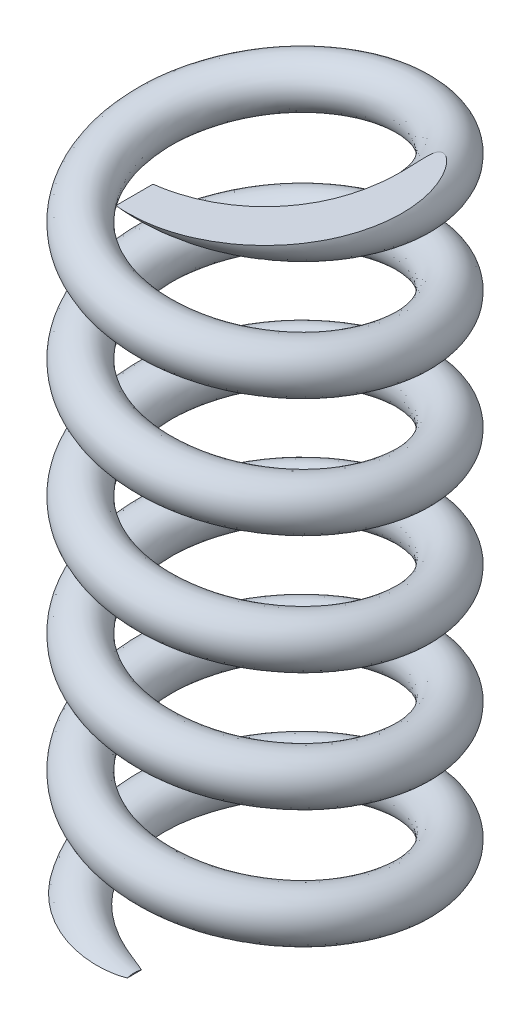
ISO-10303-21;
HEADER;
FILE_DESCRIPTION(('STEP AP214'),'2;1');
FILE_NAME('part.step','',(''),(''),'','','');
FILE_SCHEMA(('AUTOMOTIVE_DESIGN { 1 0 10303 214 1 1 1 1 }'));
ENDSEC;
DATA;
#1=APPLICATION_CONTEXT('core data for automotive mechanical design processes');
#2=APPLICATION_PROTOCOL_DEFINITION('international standard','automotive_design',2000,#1);
#3=PRODUCT_CONTEXT('',#1,'mechanical');
#4=PRODUCT('Part','Part','',(#3));
#5=PRODUCT_RELATED_PRODUCT_CATEGORY('part','',(#4));
#6=PRODUCT_DEFINITION_FORMATION('','',#4);
#7=PRODUCT_DEFINITION_CONTEXT('part definition',#1,'design');
#8=PRODUCT_DEFINITION('design','',#6,#7);
#9=PRODUCT_DEFINITION_SHAPE('','',#8);
#10=(LENGTH_UNIT() NAMED_UNIT(*) SI_UNIT(.MILLI.,.METRE.));
#11=(NAMED_UNIT(*) PLANE_ANGLE_UNIT() SI_UNIT($,.RADIAN.));
#12=(NAMED_UNIT(*) SI_UNIT($,.STERADIAN.) SOLID_ANGLE_UNIT());
#13=UNCERTAINTY_MEASURE_WITH_UNIT(LENGTH_MEASURE(1.E-05),#10,'distance_accuracy_value','');
#14=(GEOMETRIC_REPRESENTATION_CONTEXT(3) GLOBAL_UNCERTAINTY_ASSIGNED_CONTEXT((#13)) GLOBAL_UNIT_ASSIGNED_CONTEXT((#10,
#11,#12)) REPRESENTATION_CONTEXT('',''));
#15=CARTESIAN_POINT('',(0.,0.,0.));
#16=DIRECTION('',(0.,0.,1.));
#17=DIRECTION('',(1.,0.,0.));
#18=AXIS2_PLACEMENT_3D('',#15,#16,#17);
#19=CARTESIAN_POINT('',(0.,15.,3.24999999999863));
#20=DIRECTION('',(-1.,0.,0.));
#21=DIRECTION('',(0.,0.,1.));
#22=AXIS2_PLACEMENT_3D('',#19,#20,#21);
#23=PLANE('',#22);
#24=CARTESIAN_POINT('',(0.,15.,2.74999999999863));
#25=DIRECTION('',(-1.,0.,0.));
#26=DIRECTION('',(0.,0.,1.));
#27=AXIS2_PLACEMENT_3D('',#24,#25,#26);
#28=CIRCLE('',#27,0.5);
#29=CARTESIAN_POINT('',(0.,14.6868145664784,2.36023740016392));
#30=VERTEX_POINT('',#29);
#31=CARTESIAN_POINT('',(0.,14.6868145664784,3.13976259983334));
#32=VERTEX_POINT('',#31);
#33=EDGE_CURVE('E64',#30,#32,#28,.T.);
#34=ORIENTED_EDGE('',*,*,#33,.T.);
#35=DIRECTION('',(0.,0.,-1.));
#36=VECTOR('',#35,1.);
#37=CARTESIAN_POINT('',(0.,14.6868145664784,3.24999999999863));
#38=LINE('',#37,#36);
#39=EDGE_CURVE('E71',#32,#30,#38,.T.);
#40=ORIENTED_EDGE('',*,*,#39,.T.);
#41=EDGE_LOOP('',(#34,#40));
#42=FACE_BOUND('',#41,.T.);
#43=ADVANCED_FACE('F36',(#42),#23,.T.);
#44=CARTESIAN_POINT('',(0.,0.,2.24999999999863));
#45=CARTESIAN_POINT('',(-0.731069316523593,0.125,2.24999999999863));
#46=CARTESIAN_POINT('',(-1.32251681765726,0.25,1.82028823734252));
#47=CARTESIAN_POINT('',(-1.91396431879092,0.375,1.39057647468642));
#48=CARTESIAN_POINT('',(-2.13987716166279,0.5,0.695288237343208));
#49=CARTESIAN_POINT('',(-2.36579000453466,0.625,0.));
#50=CARTESIAN_POINT('',(-2.13987716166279,0.75,-0.695288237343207));
#51=CARTESIAN_POINT('',(-1.91396431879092,0.875,-1.39057647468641));
#52=CARTESIAN_POINT('',(-1.32251681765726,1.,-1.82028823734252));
#53=CARTESIAN_POINT('',(-0.731069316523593,1.125,-2.24999999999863));
#54=CARTESIAN_POINT('',(0.,1.25,-2.24999999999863));
#55=CARTESIAN_POINT('',(0.731069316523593,1.375,-2.24999999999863));
#56=CARTESIAN_POINT('',(1.32251681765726,1.5,-1.82028823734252));
#57=CARTESIAN_POINT('',(1.91396431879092,1.625,-1.39057647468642));
#58=CARTESIAN_POINT('',(2.13987716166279,1.75,-0.695288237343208));
#59=CARTESIAN_POINT('',(2.36579000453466,1.875,0.));
#60=CARTESIAN_POINT('',(2.13987716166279,2.,0.695288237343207));
#61=CARTESIAN_POINT('',(1.91396431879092,2.125,1.39057647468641));
#62=CARTESIAN_POINT('',(1.32251681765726,2.25,1.82028823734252));
#63=CARTESIAN_POINT('',(0.731069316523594,2.375,2.24999999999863));
#64=CARTESIAN_POINT('',(0.,2.5,2.24999999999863));
#65=CARTESIAN_POINT('',(-0.731069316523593,2.625,2.24999999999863));
#66=CARTESIAN_POINT('',(-1.32251681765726,2.75,1.82028823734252));
#67=CARTESIAN_POINT('',(-1.91396431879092,2.875,1.39057647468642));
#68=CARTESIAN_POINT('',(-2.13987716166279,3.,0.695288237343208));
#69=CARTESIAN_POINT('',(-2.36579000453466,3.125,0.));
#70=CARTESIAN_POINT('',(-2.13987716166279,3.25,-0.695288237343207));
#71=CARTESIAN_POINT('',(-1.91396431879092,3.375,-1.39057647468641));
#72=CARTESIAN_POINT('',(-1.32251681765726,3.5,-1.82028823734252));
#73=CARTESIAN_POINT('',(-0.731069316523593,3.625,-2.24999999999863));
#74=CARTESIAN_POINT('',(0.,3.75,-2.24999999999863));
#75=CARTESIAN_POINT('',(0.731069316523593,3.875,-2.24999999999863));
#76=CARTESIAN_POINT('',(1.32251681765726,4.,-1.82028823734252));
#77=CARTESIAN_POINT('',(1.91396431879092,4.125,-1.39057647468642));
#78=CARTESIAN_POINT('',(2.13987716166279,4.25,-0.695288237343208));
#79=CARTESIAN_POINT('',(2.36579000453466,4.375,0.));
#80=CARTESIAN_POINT('',(2.13987716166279,4.5,0.695288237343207));
#81=CARTESIAN_POINT('',(1.91396431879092,4.625,1.39057647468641));
#82=CARTESIAN_POINT('',(1.32251681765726,4.75,1.82028823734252));
#83=CARTESIAN_POINT('',(0.731069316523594,4.875,2.24999999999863));
#84=CARTESIAN_POINT('',(0.,5.,2.24999999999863));
#85=CARTESIAN_POINT('',(-0.731069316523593,5.125,2.24999999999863));
#86=CARTESIAN_POINT('',(-1.32251681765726,5.25,1.82028823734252));
#87=CARTESIAN_POINT('',(-1.91396431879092,5.375,1.39057647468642));
#88=CARTESIAN_POINT('',(-2.13987716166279,5.5,0.695288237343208));
#89=CARTESIAN_POINT('',(-2.36579000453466,5.625,0.));
#90=CARTESIAN_POINT('',(-2.13987716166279,5.75,-0.695288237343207));
#91=CARTESIAN_POINT('',(-1.91396431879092,5.875,-1.39057647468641));
#92=CARTESIAN_POINT('',(-1.32251681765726,6.,-1.82028823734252));
#93=CARTESIAN_POINT('',(-0.731069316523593,6.125,-2.24999999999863));
#94=CARTESIAN_POINT('',(0.,6.25,-2.24999999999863));
#95=CARTESIAN_POINT('',(0.731069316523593,6.375,-2.24999999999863));
#96=CARTESIAN_POINT('',(1.32251681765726,6.5,-1.82028823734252));
#97=CARTESIAN_POINT('',(1.91396431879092,6.625,-1.39057647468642));
#98=CARTESIAN_POINT('',(2.13987716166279,6.75,-0.695288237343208));
#99=CARTESIAN_POINT('',(2.36579000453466,6.875,0.));
#100=CARTESIAN_POINT('',(2.13987716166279,7.,0.695288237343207));
#101=CARTESIAN_POINT('',(1.91396431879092,7.125,1.39057647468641));
#102=CARTESIAN_POINT('',(1.32251681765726,7.25,1.82028823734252));
#103=CARTESIAN_POINT('',(0.731069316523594,7.375,2.24999999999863));
#104=CARTESIAN_POINT('',(0.,7.5,2.24999999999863));
#105=CARTESIAN_POINT('',(-0.731069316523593,7.625,2.24999999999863));
#106=CARTESIAN_POINT('',(-1.32251681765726,7.75,1.82028823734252));
#107=CARTESIAN_POINT('',(-1.91396431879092,7.875,1.39057647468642));
#108=CARTESIAN_POINT('',(-2.13987716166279,8.,0.695288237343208));
#109=CARTESIAN_POINT('',(-2.36579000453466,8.125,0.));
#110=CARTESIAN_POINT('',(-2.13987716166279,8.25,-0.695288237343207));
#111=CARTESIAN_POINT('',(-1.91396431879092,8.375,-1.39057647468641));
#112=CARTESIAN_POINT('',(-1.32251681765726,8.5,-1.82028823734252));
#113=CARTESIAN_POINT('',(-0.731069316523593,8.625,-2.24999999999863));
#114=CARTESIAN_POINT('',(0.,8.75,-2.24999999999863));
#115=CARTESIAN_POINT('',(0.731069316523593,8.875,-2.24999999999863));
#116=CARTESIAN_POINT('',(1.32251681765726,9.,-1.82028823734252));
#117=CARTESIAN_POINT('',(1.91396431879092,9.125,-1.39057647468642));
#118=CARTESIAN_POINT('',(2.13987716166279,9.25,-0.695288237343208));
#119=CARTESIAN_POINT('',(2.36579000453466,9.375,0.));
#120=CARTESIAN_POINT('',(2.13987716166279,9.5,0.695288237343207));
#121=CARTESIAN_POINT('',(1.91396431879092,9.625,1.39057647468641));
#122=CARTESIAN_POINT('',(1.32251681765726,9.75,1.82028823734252));
#123=CARTESIAN_POINT('',(0.731069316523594,9.875,2.24999999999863));
#124=CARTESIAN_POINT('',(0.,10.,2.24999999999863));
#125=CARTESIAN_POINT('',(-0.731069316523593,10.125,2.24999999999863));
#126=CARTESIAN_POINT('',(-1.32251681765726,10.25,1.82028823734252));
#127=CARTESIAN_POINT('',(-1.91396431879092,10.375,1.39057647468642));
#128=CARTESIAN_POINT('',(-2.13987716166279,10.5,0.695288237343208));
#129=CARTESIAN_POINT('',(-2.36579000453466,10.625,0.));
#130=CARTESIAN_POINT('',(-2.13987716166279,10.75,-0.695288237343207));
#131=CARTESIAN_POINT('',(-1.91396431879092,10.875,-1.39057647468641));
#132=CARTESIAN_POINT('',(-1.32251681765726,11.,-1.82028823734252));
#133=CARTESIAN_POINT('',(-0.731069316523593,11.125,-2.24999999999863));
#134=CARTESIAN_POINT('',(0.,11.25,-2.24999999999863));
#135=CARTESIAN_POINT('',(0.731069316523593,11.375,-2.24999999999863));
#136=CARTESIAN_POINT('',(1.32251681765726,11.5,-1.82028823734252));
#137=CARTESIAN_POINT('',(1.91396431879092,11.625,-1.39057647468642));
#138=CARTESIAN_POINT('',(2.13987716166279,11.75,-0.695288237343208));
#139=CARTESIAN_POINT('',(2.36579000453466,11.875,0.));
#140=CARTESIAN_POINT('',(2.13987716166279,12.,0.695288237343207));
#141=CARTESIAN_POINT('',(1.91396431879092,12.125,1.39057647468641));
#142=CARTESIAN_POINT('',(1.32251681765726,12.25,1.82028823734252));
#143=CARTESIAN_POINT('',(0.731069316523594,12.375,2.24999999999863));
#144=CARTESIAN_POINT('',(0.,12.5,2.24999999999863));
#145=CARTESIAN_POINT('',(-0.731069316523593,12.625,2.24999999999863));
#146=CARTESIAN_POINT('',(-1.32251681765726,12.75,1.82028823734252));
#147=CARTESIAN_POINT('',(-1.91396431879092,12.875,1.39057647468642));
#148=CARTESIAN_POINT('',(-2.13987716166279,13.,0.695288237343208));
#149=CARTESIAN_POINT('',(-2.36579000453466,13.125,0.));
#150=CARTESIAN_POINT('',(-2.13987716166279,13.25,-0.695288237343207));
#151=CARTESIAN_POINT('',(-1.91396431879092,13.375,-1.39057647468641));
#152=CARTESIAN_POINT('',(-1.32251681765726,13.5,-1.82028823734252));
#153=CARTESIAN_POINT('',(-0.731069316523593,13.625,-2.24999999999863));
#154=CARTESIAN_POINT('',(0.,13.75,-2.24999999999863));
#155=CARTESIAN_POINT('',(0.731069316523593,13.875,-2.24999999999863));
#156=CARTESIAN_POINT('',(1.32251681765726,14.,-1.82028823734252));
#157=CARTESIAN_POINT('',(1.91396431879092,14.125,-1.39057647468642));
#158=CARTESIAN_POINT('',(2.13987716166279,14.25,-0.695288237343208));
#159=CARTESIAN_POINT('',(2.36579000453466,14.375,0.));
#160=CARTESIAN_POINT('',(2.13987716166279,14.5,0.695288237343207));
#161=CARTESIAN_POINT('',(1.91396431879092,14.625,1.39057647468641));
#162=CARTESIAN_POINT('',(1.32251681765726,14.75,1.82028823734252));
#163=CARTESIAN_POINT('',(0.731069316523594,14.875,2.24999999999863));
#164=CARTESIAN_POINT('',(0.,15.,2.24999999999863));
#165=CARTESIAN_POINT('',(0.,1.,2.24999999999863));
#166=CARTESIAN_POINT('',(-0.731069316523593,1.125,2.24999999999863));
#167=CARTESIAN_POINT('',(-1.32251681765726,1.25,1.82028823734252));
#168=CARTESIAN_POINT('',(-1.91396431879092,1.375,1.39057647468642));
#169=CARTESIAN_POINT('',(-2.13987716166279,1.5,0.695288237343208));
#170=CARTESIAN_POINT('',(-2.36579000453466,1.625,0.));
#171=CARTESIAN_POINT('',(-2.13987716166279,1.75,-0.695288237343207));
#172=CARTESIAN_POINT('',(-1.91396431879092,1.875,-1.39057647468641));
#173=CARTESIAN_POINT('',(-1.32251681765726,2.,-1.82028823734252));
#174=CARTESIAN_POINT('',(-0.731069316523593,2.125,-2.24999999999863));
#175=CARTESIAN_POINT('',(0.,2.25,-2.24999999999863));
#176=CARTESIAN_POINT('',(0.731069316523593,2.375,-2.24999999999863));
#177=CARTESIAN_POINT('',(1.32251681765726,2.5,-1.82028823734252));
#178=CARTESIAN_POINT('',(1.91396431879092,2.625,-1.39057647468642));
#179=CARTESIAN_POINT('',(2.13987716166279,2.75,-0.695288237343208));
#180=CARTESIAN_POINT('',(2.36579000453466,2.875,0.));
#181=CARTESIAN_POINT('',(2.13987716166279,3.,0.695288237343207));
#182=CARTESIAN_POINT('',(1.91396431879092,3.125,1.39057647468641));
#183=CARTESIAN_POINT('',(1.32251681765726,3.25,1.82028823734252));
#184=CARTESIAN_POINT('',(0.731069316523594,3.375,2.24999999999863));
#185=CARTESIAN_POINT('',(0.,3.5,2.24999999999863));
#186=CARTESIAN_POINT('',(-0.731069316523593,3.625,2.24999999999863));
#187=CARTESIAN_POINT('',(-1.32251681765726,3.75,1.82028823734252));
#188=CARTESIAN_POINT('',(-1.91396431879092,3.875,1.39057647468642));
#189=CARTESIAN_POINT('',(-2.13987716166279,4.,0.695288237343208));
#190=CARTESIAN_POINT('',(-2.36579000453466,4.125,0.));
#191=CARTESIAN_POINT('',(-2.13987716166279,4.25,-0.695288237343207));
#192=CARTESIAN_POINT('',(-1.91396431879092,4.375,-1.39057647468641));
#193=CARTESIAN_POINT('',(-1.32251681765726,4.5,-1.82028823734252));
#194=CARTESIAN_POINT('',(-0.731069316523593,4.625,-2.24999999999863));
#195=CARTESIAN_POINT('',(0.,4.75,-2.24999999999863));
#196=CARTESIAN_POINT('',(0.731069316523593,4.875,-2.24999999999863));
#197=CARTESIAN_POINT('',(1.32251681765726,5.,-1.82028823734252));
#198=CARTESIAN_POINT('',(1.91396431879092,5.125,-1.39057647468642));
#199=CARTESIAN_POINT('',(2.13987716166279,5.25,-0.695288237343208));
#200=CARTESIAN_POINT('',(2.36579000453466,5.375,0.));
#201=CARTESIAN_POINT('',(2.13987716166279,5.5,0.695288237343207));
#202=CARTESIAN_POINT('',(1.91396431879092,5.625,1.39057647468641));
#203=CARTESIAN_POINT('',(1.32251681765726,5.75,1.82028823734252));
#204=CARTESIAN_POINT('',(0.731069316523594,5.875,2.24999999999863));
#205=CARTESIAN_POINT('',(0.,6.,2.24999999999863));
#206=CARTESIAN_POINT('',(-0.731069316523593,6.125,2.24999999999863));
#207=CARTESIAN_POINT('',(-1.32251681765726,6.25,1.82028823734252));
#208=CARTESIAN_POINT('',(-1.91396431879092,6.375,1.39057647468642));
#209=CARTESIAN_POINT('',(-2.13987716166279,6.5,0.695288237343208));
#210=CARTESIAN_POINT('',(-2.36579000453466,6.625,0.));
#211=CARTESIAN_POINT('',(-2.13987716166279,6.75,-0.695288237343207));
#212=CARTESIAN_POINT('',(-1.91396431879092,6.875,-1.39057647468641));
#213=CARTESIAN_POINT('',(-1.32251681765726,7.,-1.82028823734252));
#214=CARTESIAN_POINT('',(-0.731069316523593,7.125,-2.24999999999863));
#215=CARTESIAN_POINT('',(0.,7.25,-2.24999999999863));
#216=CARTESIAN_POINT('',(0.731069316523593,7.375,-2.24999999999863));
#217=CARTESIAN_POINT('',(1.32251681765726,7.5,-1.82028823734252));
#218=CARTESIAN_POINT('',(1.91396431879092,7.625,-1.39057647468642));
#219=CARTESIAN_POINT('',(2.13987716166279,7.75,-0.695288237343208));
#220=CARTESIAN_POINT('',(2.36579000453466,7.875,0.));
#221=CARTESIAN_POINT('',(2.13987716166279,8.,0.695288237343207));
#222=CARTESIAN_POINT('',(1.91396431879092,8.125,1.39057647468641));
#223=CARTESIAN_POINT('',(1.32251681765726,8.25,1.82028823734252));
#224=CARTESIAN_POINT('',(0.731069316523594,8.375,2.24999999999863));
#225=CARTESIAN_POINT('',(0.,8.5,2.24999999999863));
#226=CARTESIAN_POINT('',(-0.731069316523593,8.625,2.24999999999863));
#227=CARTESIAN_POINT('',(-1.32251681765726,8.75,1.82028823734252));
#228=CARTESIAN_POINT('',(-1.91396431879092,8.875,1.39057647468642));
#229=CARTESIAN_POINT('',(-2.13987716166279,9.,0.695288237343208));
#230=CARTESIAN_POINT('',(-2.36579000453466,9.125,0.));
#231=CARTESIAN_POINT('',(-2.13987716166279,9.25,-0.695288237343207));
#232=CARTESIAN_POINT('',(-1.91396431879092,9.375,-1.39057647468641));
#233=CARTESIAN_POINT('',(-1.32251681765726,9.5,-1.82028823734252));
#234=CARTESIAN_POINT('',(-0.731069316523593,9.625,-2.24999999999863));
#235=CARTESIAN_POINT('',(0.,9.75,-2.24999999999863));
#236=CARTESIAN_POINT('',(0.731069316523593,9.875,-2.24999999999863));
#237=CARTESIAN_POINT('',(1.32251681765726,10.,-1.82028823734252));
#238=CARTESIAN_POINT('',(1.91396431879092,10.125,-1.39057647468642));
#239=CARTESIAN_POINT('',(2.13987716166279,10.25,-0.695288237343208));
#240=CARTESIAN_POINT('',(2.36579000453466,10.375,0.));
#241=CARTESIAN_POINT('',(2.13987716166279,10.5,0.695288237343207));
#242=CARTESIAN_POINT('',(1.91396431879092,10.625,1.39057647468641));
#243=CARTESIAN_POINT('',(1.32251681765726,10.75,1.82028823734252));
#244=CARTESIAN_POINT('',(0.731069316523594,10.875,2.24999999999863));
#245=CARTESIAN_POINT('',(0.,11.,2.24999999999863));
#246=CARTESIAN_POINT('',(-0.731069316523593,11.125,2.24999999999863));
#247=CARTESIAN_POINT('',(-1.32251681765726,11.25,1.82028823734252));
#248=CARTESIAN_POINT('',(-1.91396431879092,11.375,1.39057647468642));
#249=CARTESIAN_POINT('',(-2.13987716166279,11.5,0.695288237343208));
#250=CARTESIAN_POINT('',(-2.36579000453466,11.625,0.));
#251=CARTESIAN_POINT('',(-2.13987716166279,11.75,-0.695288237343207));
#252=CARTESIAN_POINT('',(-1.91396431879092,11.875,-1.39057647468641));
#253=CARTESIAN_POINT('',(-1.32251681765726,12.,-1.82028823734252));
#254=CARTESIAN_POINT('',(-0.731069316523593,12.125,-2.24999999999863));
#255=CARTESIAN_POINT('',(0.,12.25,-2.24999999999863));
#256=CARTESIAN_POINT('',(0.731069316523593,12.375,-2.24999999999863));
#257=CARTESIAN_POINT('',(1.32251681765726,12.5,-1.82028823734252));
#258=CARTESIAN_POINT('',(1.91396431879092,12.625,-1.39057647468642));
#259=CARTESIAN_POINT('',(2.13987716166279,12.75,-0.695288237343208));
#260=CARTESIAN_POINT('',(2.36579000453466,12.875,0.));
#261=CARTESIAN_POINT('',(2.13987716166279,13.,0.695288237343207));
#262=CARTESIAN_POINT('',(1.91396431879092,13.125,1.39057647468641));
#263=CARTESIAN_POINT('',(1.32251681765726,13.25,1.82028823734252));
#264=CARTESIAN_POINT('',(0.731069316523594,13.375,2.24999999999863));
#265=CARTESIAN_POINT('',(0.,13.5,2.24999999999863));
#266=CARTESIAN_POINT('',(-0.731069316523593,13.625,2.24999999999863));
#267=CARTESIAN_POINT('',(-1.32251681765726,13.75,1.82028823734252));
#268=CARTESIAN_POINT('',(-1.91396431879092,13.875,1.39057647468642));
#269=CARTESIAN_POINT('',(-2.13987716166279,14.,0.695288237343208));
#270=CARTESIAN_POINT('',(-2.36579000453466,14.125,0.));
#271=CARTESIAN_POINT('',(-2.13987716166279,14.25,-0.695288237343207));
#272=CARTESIAN_POINT('',(-1.91396431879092,14.375,-1.39057647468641));
#273=CARTESIAN_POINT('',(-1.32251681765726,14.5,-1.82028823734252));
#274=CARTESIAN_POINT('',(-0.731069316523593,14.625,-2.24999999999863));
#275=CARTESIAN_POINT('',(0.,14.75,-2.24999999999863));
#276=CARTESIAN_POINT('',(0.731069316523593,14.875,-2.24999999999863));
#277=CARTESIAN_POINT('',(1.32251681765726,15.,-1.82028823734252));
#278=CARTESIAN_POINT('',(1.91396431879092,15.125,-1.39057647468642));
#279=CARTESIAN_POINT('',(2.13987716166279,15.25,-0.695288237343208));
#280=CARTESIAN_POINT('',(2.36579000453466,15.375,0.));
#281=CARTESIAN_POINT('',(2.13987716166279,15.5,0.695288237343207));
#282=CARTESIAN_POINT('',(1.91396431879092,15.625,1.39057647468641));
#283=CARTESIAN_POINT('',(1.32251681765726,15.75,1.82028823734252));
#284=CARTESIAN_POINT('',(0.731069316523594,15.875,2.24999999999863));
#285=CARTESIAN_POINT('',(0.,16.,2.24999999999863));
#286=CARTESIAN_POINT('',(0.,1.,3.24999999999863));
#287=CARTESIAN_POINT('',(-1.0559890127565,1.125,3.24999999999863));
#288=CARTESIAN_POINT('',(-1.91030206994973,1.25,2.62930523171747));
#289=CARTESIAN_POINT('',(-2.76461512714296,1.375,2.00861046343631));
#290=CARTESIAN_POINT('',(-3.09093367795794,1.5,1.00430523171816));
#291=CARTESIAN_POINT('',(-3.41725222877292,1.625,0.));
#292=CARTESIAN_POINT('',(-3.09093367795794,1.75,-1.00430523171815));
#293=CARTESIAN_POINT('',(-2.76461512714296,1.875,-2.00861046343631));
#294=CARTESIAN_POINT('',(-1.91030206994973,2.,-2.62930523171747));
#295=CARTESIAN_POINT('',(-1.0559890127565,2.125,-3.24999999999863));
#296=CARTESIAN_POINT('',(0.,2.25,-3.24999999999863));
#297=CARTESIAN_POINT('',(1.0559890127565,2.375,-3.24999999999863));
#298=CARTESIAN_POINT('',(1.91030206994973,2.5,-2.62930523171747));
#299=CARTESIAN_POINT('',(2.76461512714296,2.625,-2.00861046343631));
#300=CARTESIAN_POINT('',(3.09093367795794,2.75,-1.00430523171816));
#301=CARTESIAN_POINT('',(3.41725222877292,2.875,0.));
#302=CARTESIAN_POINT('',(3.09093367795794,3.,1.00430523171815));
#303=CARTESIAN_POINT('',(2.76461512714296,3.125,2.00861046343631));
#304=CARTESIAN_POINT('',(1.91030206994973,3.25,2.62930523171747));
#305=CARTESIAN_POINT('',(1.0559890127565,3.375,3.24999999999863));
#306=CARTESIAN_POINT('',(0.,3.5,3.24999999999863));
#307=CARTESIAN_POINT('',(-1.0559890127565,3.625,3.24999999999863));
#308=CARTESIAN_POINT('',(-1.91030206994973,3.75,2.62930523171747));
#309=CARTESIAN_POINT('',(-2.76461512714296,3.875,2.00861046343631));
#310=CARTESIAN_POINT('',(-3.09093367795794,4.,1.00430523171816));
#311=CARTESIAN_POINT('',(-3.41725222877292,4.125,0.));
#312=CARTESIAN_POINT('',(-3.09093367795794,4.25,-1.00430523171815));
#313=CARTESIAN_POINT('',(-2.76461512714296,4.375,-2.00861046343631));
#314=CARTESIAN_POINT('',(-1.91030206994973,4.5,-2.62930523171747));
#315=CARTESIAN_POINT('',(-1.0559890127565,4.625,-3.24999999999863));
#316=CARTESIAN_POINT('',(0.,4.75,-3.24999999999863));
#317=CARTESIAN_POINT('',(1.0559890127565,4.875,-3.24999999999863));
#318=CARTESIAN_POINT('',(1.91030206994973,5.,-2.62930523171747));
#319=CARTESIAN_POINT('',(2.76461512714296,5.125,-2.00861046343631));
#320=CARTESIAN_POINT('',(3.09093367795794,5.25,-1.00430523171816));
#321=CARTESIAN_POINT('',(3.41725222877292,5.375,0.));
#322=CARTESIAN_POINT('',(3.09093367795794,5.5,1.00430523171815));
#323=CARTESIAN_POINT('',(2.76461512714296,5.625,2.00861046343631));
#324=CARTESIAN_POINT('',(1.91030206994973,5.75,2.62930523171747));
#325=CARTESIAN_POINT('',(1.0559890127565,5.875,3.24999999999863));
#326=CARTESIAN_POINT('',(0.,6.,3.24999999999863));
#327=CARTESIAN_POINT('',(-1.0559890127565,6.125,3.24999999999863));
#328=CARTESIAN_POINT('',(-1.91030206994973,6.25,2.62930523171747));
#329=CARTESIAN_POINT('',(-2.76461512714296,6.375,2.00861046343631));
#330=CARTESIAN_POINT('',(-3.09093367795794,6.5,1.00430523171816));
#331=CARTESIAN_POINT('',(-3.41725222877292,6.625,0.));
#332=CARTESIAN_POINT('',(-3.09093367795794,6.75,-1.00430523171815));
#333=CARTESIAN_POINT('',(-2.76461512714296,6.875,-2.00861046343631));
#334=CARTESIAN_POINT('',(-1.91030206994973,7.,-2.62930523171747));
#335=CARTESIAN_POINT('',(-1.0559890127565,7.125,-3.24999999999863));
#336=CARTESIAN_POINT('',(0.,7.25,-3.24999999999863));
#337=CARTESIAN_POINT('',(1.0559890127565,7.375,-3.24999999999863));
#338=CARTESIAN_POINT('',(1.91030206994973,7.5,-2.62930523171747));
#339=CARTESIAN_POINT('',(2.76461512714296,7.625,-2.00861046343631));
#340=CARTESIAN_POINT('',(3.09093367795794,7.75,-1.00430523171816));
#341=CARTESIAN_POINT('',(3.41725222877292,7.875,0.));
#342=CARTESIAN_POINT('',(3.09093367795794,8.,1.00430523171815));
#343=CARTESIAN_POINT('',(2.76461512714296,8.125,2.00861046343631));
#344=CARTESIAN_POINT('',(1.91030206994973,8.25,2.62930523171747));
#345=CARTESIAN_POINT('',(1.0559890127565,8.375,3.24999999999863));
#346=CARTESIAN_POINT('',(0.,8.5,3.24999999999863));
#347=CARTESIAN_POINT('',(-1.0559890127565,8.625,3.24999999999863));
#348=CARTESIAN_POINT('',(-1.91030206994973,8.75,2.62930523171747));
#349=CARTESIAN_POINT('',(-2.76461512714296,8.875,2.00861046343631));
#350=CARTESIAN_POINT('',(-3.09093367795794,9.,1.00430523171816));
#351=CARTESIAN_POINT('',(-3.41725222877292,9.125,0.));
#352=CARTESIAN_POINT('',(-3.09093367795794,9.25,-1.00430523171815));
#353=CARTESIAN_POINT('',(-2.76461512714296,9.375,-2.00861046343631));
#354=CARTESIAN_POINT('',(-1.91030206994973,9.5,-2.62930523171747));
#355=CARTESIAN_POINT('',(-1.0559890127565,9.625,-3.24999999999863));
#356=CARTESIAN_POINT('',(0.,9.75,-3.24999999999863));
#357=CARTESIAN_POINT('',(1.0559890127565,9.875,-3.24999999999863));
#358=CARTESIAN_POINT('',(1.91030206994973,10.,-2.62930523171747));
#359=CARTESIAN_POINT('',(2.76461512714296,10.125,-2.00861046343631));
#360=CARTESIAN_POINT('',(3.09093367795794,10.25,-1.00430523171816));
#361=CARTESIAN_POINT('',(3.41725222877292,10.375,0.));
#362=CARTESIAN_POINT('',(3.09093367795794,10.5,1.00430523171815));
#363=CARTESIAN_POINT('',(2.76461512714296,10.625,2.00861046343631));
#364=CARTESIAN_POINT('',(1.91030206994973,10.75,2.62930523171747));
#365=CARTESIAN_POINT('',(1.0559890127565,10.875,3.24999999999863));
#366=CARTESIAN_POINT('',(0.,11.,3.24999999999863));
#367=CARTESIAN_POINT('',(-1.0559890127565,11.125,3.24999999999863));
#368=CARTESIAN_POINT('',(-1.91030206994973,11.25,2.62930523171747));
#369=CARTESIAN_POINT('',(-2.76461512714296,11.375,2.00861046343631));
#370=CARTESIAN_POINT('',(-3.09093367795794,11.5,1.00430523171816));
#371=CARTESIAN_POINT('',(-3.41725222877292,11.625,0.));
#372=CARTESIAN_POINT('',(-3.09093367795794,11.75,-1.00430523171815));
#373=CARTESIAN_POINT('',(-2.76461512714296,11.875,-2.00861046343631));
#374=CARTESIAN_POINT('',(-1.91030206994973,12.,-2.62930523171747));
#375=CARTESIAN_POINT('',(-1.0559890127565,12.125,-3.24999999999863));
#376=CARTESIAN_POINT('',(0.,12.25,-3.24999999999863));
#377=CARTESIAN_POINT('',(1.0559890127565,12.375,-3.24999999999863));
#378=CARTESIAN_POINT('',(1.91030206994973,12.5,-2.62930523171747));
#379=CARTESIAN_POINT('',(2.76461512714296,12.625,-2.00861046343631));
#380=CARTESIAN_POINT('',(3.09093367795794,12.75,-1.00430523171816));
#381=CARTESIAN_POINT('',(3.41725222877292,12.875,0.));
#382=CARTESIAN_POINT('',(3.09093367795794,13.,1.00430523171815));
#383=CARTESIAN_POINT('',(2.76461512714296,13.125,2.00861046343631));
#384=CARTESIAN_POINT('',(1.91030206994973,13.25,2.62930523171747));
#385=CARTESIAN_POINT('',(1.0559890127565,13.375,3.24999999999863));
#386=CARTESIAN_POINT('',(0.,13.5,3.24999999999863));
#387=CARTESIAN_POINT('',(-1.0559890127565,13.625,3.24999999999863));
#388=CARTESIAN_POINT('',(-1.91030206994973,13.75,2.62930523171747));
#389=CARTESIAN_POINT('',(-2.76461512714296,13.875,2.00861046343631));
#390=CARTESIAN_POINT('',(-3.09093367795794,14.,1.00430523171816));
#391=CARTESIAN_POINT('',(-3.41725222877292,14.125,0.));
#392=CARTESIAN_POINT('',(-3.09093367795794,14.25,-1.00430523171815));
#393=CARTESIAN_POINT('',(-2.76461512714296,14.375,-2.00861046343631));
#394=CARTESIAN_POINT('',(-1.91030206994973,14.5,-2.62930523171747));
#395=CARTESIAN_POINT('',(-1.0559890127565,14.625,-3.24999999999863));
#396=CARTESIAN_POINT('',(0.,14.75,-3.24999999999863));
#397=CARTESIAN_POINT('',(1.0559890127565,14.875,-3.24999999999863));
#398=CARTESIAN_POINT('',(1.91030206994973,15.,-2.62930523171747));
#399=CARTESIAN_POINT('',(2.76461512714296,15.125,-2.00861046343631));
#400=CARTESIAN_POINT('',(3.09093367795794,15.25,-1.00430523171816));
#401=CARTESIAN_POINT('',(3.41725222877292,15.375,0.));
#402=CARTESIAN_POINT('',(3.09093367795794,15.5,1.00430523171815));
#403=CARTESIAN_POINT('',(2.76461512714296,15.625,2.00861046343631));
#404=CARTESIAN_POINT('',(1.91030206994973,15.75,2.62930523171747));
#405=CARTESIAN_POINT('',(1.0559890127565,15.875,3.24999999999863));
#406=CARTESIAN_POINT('',(0.,16.,3.24999999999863));
#407=CARTESIAN_POINT('',(0.,0.,3.24999999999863));
#408=CARTESIAN_POINT('',(-1.0559890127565,0.125,3.24999999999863));
#409=CARTESIAN_POINT('',(-1.91030206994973,0.25,2.62930523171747));
#410=CARTESIAN_POINT('',(-2.76461512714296,0.375,2.00861046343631));
#411=CARTESIAN_POINT('',(-3.09093367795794,0.5,1.00430523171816));
#412=CARTESIAN_POINT('',(-3.41725222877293,0.625,0.));
#413=CARTESIAN_POINT('',(-3.09093367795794,0.75,-1.00430523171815));
#414=CARTESIAN_POINT('',(-2.76461512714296,0.875,-2.00861046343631));
#415=CARTESIAN_POINT('',(-1.91030206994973,1.,-2.62930523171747));
#416=CARTESIAN_POINT('',(-1.0559890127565,1.125,-3.24999999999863));
#417=CARTESIAN_POINT('',(0.,1.25,-3.24999999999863));
#418=CARTESIAN_POINT('',(1.0559890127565,1.375,-3.24999999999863));
#419=CARTESIAN_POINT('',(1.91030206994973,1.5,-2.62930523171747));
#420=CARTESIAN_POINT('',(2.76461512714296,1.625,-2.00861046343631));
#421=CARTESIAN_POINT('',(3.09093367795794,1.75,-1.00430523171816));
#422=CARTESIAN_POINT('',(3.41725222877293,1.875,0.));
#423=CARTESIAN_POINT('',(3.09093367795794,2.,1.00430523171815));
#424=CARTESIAN_POINT('',(2.76461512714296,2.125,2.00861046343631));
#425=CARTESIAN_POINT('',(1.91030206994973,2.25,2.62930523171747));
#426=CARTESIAN_POINT('',(1.0559890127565,2.375,3.24999999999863));
#427=CARTESIAN_POINT('',(0.,2.5,3.24999999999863));
#428=CARTESIAN_POINT('',(-1.0559890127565,2.625,3.24999999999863));
#429=CARTESIAN_POINT('',(-1.91030206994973,2.75,2.62930523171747));
#430=CARTESIAN_POINT('',(-2.76461512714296,2.875,2.00861046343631));
#431=CARTESIAN_POINT('',(-3.09093367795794,3.,1.00430523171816));
#432=CARTESIAN_POINT('',(-3.41725222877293,3.125,0.));
#433=CARTESIAN_POINT('',(-3.09093367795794,3.25,-1.00430523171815));
#434=CARTESIAN_POINT('',(-2.76461512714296,3.375,-2.00861046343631));
#435=CARTESIAN_POINT('',(-1.91030206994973,3.5,-2.62930523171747));
#436=CARTESIAN_POINT('',(-1.0559890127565,3.625,-3.24999999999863));
#437=CARTESIAN_POINT('',(0.,3.75,-3.24999999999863));
#438=CARTESIAN_POINT('',(1.0559890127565,3.875,-3.24999999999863));
#439=CARTESIAN_POINT('',(1.91030206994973,4.,-2.62930523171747));
#440=CARTESIAN_POINT('',(2.76461512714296,4.125,-2.00861046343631));
#441=CARTESIAN_POINT('',(3.09093367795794,4.25,-1.00430523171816));
#442=CARTESIAN_POINT('',(3.41725222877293,4.375,0.));
#443=CARTESIAN_POINT('',(3.09093367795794,4.5,1.00430523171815));
#444=CARTESIAN_POINT('',(2.76461512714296,4.625,2.00861046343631));
#445=CARTESIAN_POINT('',(1.91030206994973,4.75,2.62930523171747));
#446=CARTESIAN_POINT('',(1.0559890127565,4.875,3.24999999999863));
#447=CARTESIAN_POINT('',(0.,5.,3.24999999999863));
#448=CARTESIAN_POINT('',(-1.0559890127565,5.125,3.24999999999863));
#449=CARTESIAN_POINT('',(-1.91030206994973,5.25,2.62930523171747));
#450=CARTESIAN_POINT('',(-2.76461512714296,5.375,2.00861046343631));
#451=CARTESIAN_POINT('',(-3.09093367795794,5.5,1.00430523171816));
#452=CARTESIAN_POINT('',(-3.41725222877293,5.625,0.));
#453=CARTESIAN_POINT('',(-3.09093367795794,5.75,-1.00430523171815));
#454=CARTESIAN_POINT('',(-2.76461512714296,5.875,-2.00861046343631));
#455=CARTESIAN_POINT('',(-1.91030206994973,6.,-2.62930523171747));
#456=CARTESIAN_POINT('',(-1.0559890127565,6.125,-3.24999999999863));
#457=CARTESIAN_POINT('',(0.,6.25,-3.24999999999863));
#458=CARTESIAN_POINT('',(1.0559890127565,6.375,-3.24999999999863));
#459=CARTESIAN_POINT('',(1.91030206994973,6.5,-2.62930523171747));
#460=CARTESIAN_POINT('',(2.76461512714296,6.625,-2.00861046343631));
#461=CARTESIAN_POINT('',(3.09093367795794,6.75,-1.00430523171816));
#462=CARTESIAN_POINT('',(3.41725222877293,6.875,0.));
#463=CARTESIAN_POINT('',(3.09093367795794,7.,1.00430523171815));
#464=CARTESIAN_POINT('',(2.76461512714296,7.125,2.00861046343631));
#465=CARTESIAN_POINT('',(1.91030206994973,7.25,2.62930523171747));
#466=CARTESIAN_POINT('',(1.0559890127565,7.375,3.24999999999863));
#467=CARTESIAN_POINT('',(0.,7.5,3.24999999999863));
#468=CARTESIAN_POINT('',(-1.0559890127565,7.625,3.24999999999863));
#469=CARTESIAN_POINT('',(-1.91030206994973,7.75,2.62930523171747));
#470=CARTESIAN_POINT('',(-2.76461512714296,7.875,2.00861046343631));
#471=CARTESIAN_POINT('',(-3.09093367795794,8.,1.00430523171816));
#472=CARTESIAN_POINT('',(-3.41725222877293,8.125,0.));
#473=CARTESIAN_POINT('',(-3.09093367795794,8.25,-1.00430523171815));
#474=CARTESIAN_POINT('',(-2.76461512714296,8.375,-2.00861046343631));
#475=CARTESIAN_POINT('',(-1.91030206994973,8.5,-2.62930523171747));
#476=CARTESIAN_POINT('',(-1.0559890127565,8.625,-3.24999999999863));
#477=CARTESIAN_POINT('',(0.,8.75,-3.24999999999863));
#478=CARTESIAN_POINT('',(1.0559890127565,8.875,-3.24999999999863));
#479=CARTESIAN_POINT('',(1.91030206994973,9.,-2.62930523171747));
#480=CARTESIAN_POINT('',(2.76461512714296,9.125,-2.00861046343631));
#481=CARTESIAN_POINT('',(3.09093367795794,9.25,-1.00430523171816));
#482=CARTESIAN_POINT('',(3.41725222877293,9.375,0.));
#483=CARTESIAN_POINT('',(3.09093367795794,9.5,1.00430523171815));
#484=CARTESIAN_POINT('',(2.76461512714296,9.625,2.00861046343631));
#485=CARTESIAN_POINT('',(1.91030206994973,9.75,2.62930523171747));
#486=CARTESIAN_POINT('',(1.0559890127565,9.875,3.24999999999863));
#487=CARTESIAN_POINT('',(0.,10.,3.24999999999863));
#488=CARTESIAN_POINT('',(-1.0559890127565,10.125,3.24999999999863));
#489=CARTESIAN_POINT('',(-1.91030206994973,10.25,2.62930523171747));
#490=CARTESIAN_POINT('',(-2.76461512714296,10.375,2.00861046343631));
#491=CARTESIAN_POINT('',(-3.09093367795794,10.5,1.00430523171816));
#492=CARTESIAN_POINT('',(-3.41725222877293,10.625,0.));
#493=CARTESIAN_POINT('',(-3.09093367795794,10.75,-1.00430523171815));
#494=CARTESIAN_POINT('',(-2.76461512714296,10.875,-2.00861046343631));
#495=CARTESIAN_POINT('',(-1.91030206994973,11.,-2.62930523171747));
#496=CARTESIAN_POINT('',(-1.0559890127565,11.125,-3.24999999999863));
#497=CARTESIAN_POINT('',(0.,11.25,-3.24999999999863));
#498=CARTESIAN_POINT('',(1.0559890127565,11.375,-3.24999999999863));
#499=CARTESIAN_POINT('',(1.91030206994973,11.5,-2.62930523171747));
#500=CARTESIAN_POINT('',(2.76461512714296,11.625,-2.00861046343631));
#501=CARTESIAN_POINT('',(3.09093367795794,11.75,-1.00430523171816));
#502=CARTESIAN_POINT('',(3.41725222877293,11.875,0.));
#503=CARTESIAN_POINT('',(3.09093367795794,12.,1.00430523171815));
#504=CARTESIAN_POINT('',(2.76461512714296,12.125,2.00861046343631));
#505=CARTESIAN_POINT('',(1.91030206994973,12.25,2.62930523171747));
#506=CARTESIAN_POINT('',(1.0559890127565,12.375,3.24999999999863));
#507=CARTESIAN_POINT('',(0.,12.5,3.24999999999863));
#508=CARTESIAN_POINT('',(-1.0559890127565,12.625,3.24999999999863));
#509=CARTESIAN_POINT('',(-1.91030206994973,12.75,2.62930523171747));
#510=CARTESIAN_POINT('',(-2.76461512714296,12.875,2.00861046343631));
#511=CARTESIAN_POINT('',(-3.09093367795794,13.,1.00430523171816));
#512=CARTESIAN_POINT('',(-3.41725222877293,13.125,0.));
#513=CARTESIAN_POINT('',(-3.09093367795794,13.25,-1.00430523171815));
#514=CARTESIAN_POINT('',(-2.76461512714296,13.375,-2.00861046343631));
#515=CARTESIAN_POINT('',(-1.91030206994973,13.5,-2.62930523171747));
#516=CARTESIAN_POINT('',(-1.0559890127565,13.625,-3.24999999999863));
#517=CARTESIAN_POINT('',(0.,13.75,-3.24999999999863));
#518=CARTESIAN_POINT('',(1.0559890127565,13.875,-3.24999999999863));
#519=CARTESIAN_POINT('',(1.91030206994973,14.,-2.62930523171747));
#520=CARTESIAN_POINT('',(2.76461512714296,14.125,-2.00861046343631));
#521=CARTESIAN_POINT('',(3.09093367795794,14.25,-1.00430523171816));
#522=CARTESIAN_POINT('',(3.41725222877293,14.375,0.));
#523=CARTESIAN_POINT('',(3.09093367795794,14.5,1.00430523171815));
#524=CARTESIAN_POINT('',(2.76461512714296,14.625,2.00861046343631));
#525=CARTESIAN_POINT('',(1.91030206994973,14.75,2.62930523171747));
#526=CARTESIAN_POINT('',(1.0559890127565,14.875,3.24999999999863));
#527=CARTESIAN_POINT('',(0.,15.,3.24999999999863));
#528=CARTESIAN_POINT('',(0.,-1.,3.24999999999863));
#529=CARTESIAN_POINT('',(-1.0559890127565,-0.875,3.24999999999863));
#530=CARTESIAN_POINT('',(-1.91030206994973,-0.75,2.62930523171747));
#531=CARTESIAN_POINT('',(-2.76461512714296,-0.625,2.00861046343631));
#532=CARTESIAN_POINT('',(-3.09093367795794,-0.5,1.00430523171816));
#533=CARTESIAN_POINT('',(-3.41725222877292,-0.375,0.));
#534=CARTESIAN_POINT('',(-3.09093367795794,-0.25,-1.00430523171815));
#535=CARTESIAN_POINT('',(-2.76461512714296,-0.125,-2.00861046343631));
#536=CARTESIAN_POINT('',(-1.91030206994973,0.,-2.62930523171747));
#537=CARTESIAN_POINT('',(-1.0559890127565,0.125000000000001,-3.24999999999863));
#538=CARTESIAN_POINT('',(0.,0.25,-3.24999999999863));
#539=CARTESIAN_POINT('',(1.0559890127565,0.375,-3.24999999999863));
#540=CARTESIAN_POINT('',(1.91030206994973,0.5,-2.62930523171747));
#541=CARTESIAN_POINT('',(2.76461512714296,0.625000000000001,-2.00861046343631));
#542=CARTESIAN_POINT('',(3.09093367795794,0.75,-1.00430523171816));
#543=CARTESIAN_POINT('',(3.41725222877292,0.875,0.));
#544=CARTESIAN_POINT('',(3.09093367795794,1.,1.00430523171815));
#545=CARTESIAN_POINT('',(2.76461512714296,1.125,2.00861046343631));
#546=CARTESIAN_POINT('',(1.91030206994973,1.25,2.62930523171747));
#547=CARTESIAN_POINT('',(1.0559890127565,1.375,3.24999999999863));
#548=CARTESIAN_POINT('',(0.,1.5,3.24999999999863));
#549=CARTESIAN_POINT('',(-1.0559890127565,1.625,3.24999999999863));
#550=CARTESIAN_POINT('',(-1.91030206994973,1.75,2.62930523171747));
#551=CARTESIAN_POINT('',(-2.76461512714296,1.875,2.00861046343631));
#552=CARTESIAN_POINT('',(-3.09093367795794,2.,1.00430523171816));
#553=CARTESIAN_POINT('',(-3.41725222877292,2.125,0.));
#554=CARTESIAN_POINT('',(-3.09093367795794,2.25,-1.00430523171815));
#555=CARTESIAN_POINT('',(-2.76461512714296,2.375,-2.00861046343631));
#556=CARTESIAN_POINT('',(-1.91030206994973,2.5,-2.62930523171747));
#557=CARTESIAN_POINT('',(-1.0559890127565,2.625,-3.24999999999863));
#558=CARTESIAN_POINT('',(0.,2.75,-3.24999999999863));
#559=CARTESIAN_POINT('',(1.0559890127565,2.875,-3.24999999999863));
#560=CARTESIAN_POINT('',(1.91030206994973,3.,-2.62930523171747));
#561=CARTESIAN_POINT('',(2.76461512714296,3.125,-2.00861046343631));
#562=CARTESIAN_POINT('',(3.09093367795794,3.25,-1.00430523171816));
#563=CARTESIAN_POINT('',(3.41725222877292,3.375,0.));
#564=CARTESIAN_POINT('',(3.09093367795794,3.5,1.00430523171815));
#565=CARTESIAN_POINT('',(2.76461512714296,3.625,2.00861046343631));
#566=CARTESIAN_POINT('',(1.91030206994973,3.75,2.62930523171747));
#567=CARTESIAN_POINT('',(1.0559890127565,3.875,3.24999999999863));
#568=CARTESIAN_POINT('',(0.,4.,3.24999999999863));
#569=CARTESIAN_POINT('',(-1.0559890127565,4.125,3.24999999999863));
#570=CARTESIAN_POINT('',(-1.91030206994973,4.25,2.62930523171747));
#571=CARTESIAN_POINT('',(-2.76461512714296,4.375,2.00861046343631));
#572=CARTESIAN_POINT('',(-3.09093367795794,4.5,1.00430523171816));
#573=CARTESIAN_POINT('',(-3.41725222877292,4.625,0.));
#574=CARTESIAN_POINT('',(-3.09093367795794,4.75,-1.00430523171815));
#575=CARTESIAN_POINT('',(-2.76461512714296,4.875,-2.00861046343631));
#576=CARTESIAN_POINT('',(-1.91030206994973,5.,-2.62930523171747));
#577=CARTESIAN_POINT('',(-1.0559890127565,5.125,-3.24999999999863));
#578=CARTESIAN_POINT('',(0.,5.25,-3.24999999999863));
#579=CARTESIAN_POINT('',(1.0559890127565,5.375,-3.24999999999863));
#580=CARTESIAN_POINT('',(1.91030206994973,5.5,-2.62930523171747));
#581=CARTESIAN_POINT('',(2.76461512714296,5.625,-2.00861046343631));
#582=CARTESIAN_POINT('',(3.09093367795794,5.75,-1.00430523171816));
#583=CARTESIAN_POINT('',(3.41725222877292,5.875,0.));
#584=CARTESIAN_POINT('',(3.09093367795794,6.,1.00430523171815));
#585=CARTESIAN_POINT('',(2.76461512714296,6.125,2.00861046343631));
#586=CARTESIAN_POINT('',(1.91030206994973,6.25,2.62930523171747));
#587=CARTESIAN_POINT('',(1.0559890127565,6.375,3.24999999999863));
#588=CARTESIAN_POINT('',(0.,6.5,3.24999999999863));
#589=CARTESIAN_POINT('',(-1.0559890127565,6.625,3.24999999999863));
#590=CARTESIAN_POINT('',(-1.91030206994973,6.75,2.62930523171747));
#591=CARTESIAN_POINT('',(-2.76461512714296,6.875,2.00861046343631));
#592=CARTESIAN_POINT('',(-3.09093367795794,7.,1.00430523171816));
#593=CARTESIAN_POINT('',(-3.41725222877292,7.125,0.));
#594=CARTESIAN_POINT('',(-3.09093367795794,7.25,-1.00430523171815));
#595=CARTESIAN_POINT('',(-2.76461512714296,7.375,-2.00861046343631));
#596=CARTESIAN_POINT('',(-1.91030206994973,7.5,-2.62930523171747));
#597=CARTESIAN_POINT('',(-1.0559890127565,7.625,-3.24999999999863));
#598=CARTESIAN_POINT('',(0.,7.75,-3.24999999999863));
#599=CARTESIAN_POINT('',(1.0559890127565,7.875,-3.24999999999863));
#600=CARTESIAN_POINT('',(1.91030206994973,8.,-2.62930523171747));
#601=CARTESIAN_POINT('',(2.76461512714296,8.125,-2.00861046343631));
#602=CARTESIAN_POINT('',(3.09093367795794,8.25,-1.00430523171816));
#603=CARTESIAN_POINT('',(3.41725222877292,8.375,0.));
#604=CARTESIAN_POINT('',(3.09093367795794,8.5,1.00430523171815));
#605=CARTESIAN_POINT('',(2.76461512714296,8.625,2.00861046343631));
#606=CARTESIAN_POINT('',(1.91030206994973,8.75,2.62930523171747));
#607=CARTESIAN_POINT('',(1.0559890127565,8.875,3.24999999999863));
#608=CARTESIAN_POINT('',(0.,9.,3.24999999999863));
#609=CARTESIAN_POINT('',(-1.0559890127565,9.125,3.24999999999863));
#610=CARTESIAN_POINT('',(-1.91030206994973,9.25,2.62930523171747));
#611=CARTESIAN_POINT('',(-2.76461512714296,9.375,2.00861046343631));
#612=CARTESIAN_POINT('',(-3.09093367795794,9.5,1.00430523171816));
#613=CARTESIAN_POINT('',(-3.41725222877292,9.625,0.));
#614=CARTESIAN_POINT('',(-3.09093367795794,9.75,-1.00430523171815));
#615=CARTESIAN_POINT('',(-2.76461512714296,9.875,-2.00861046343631));
#616=CARTESIAN_POINT('',(-1.91030206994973,10.,-2.62930523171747));
#617=CARTESIAN_POINT('',(-1.0559890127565,10.125,-3.24999999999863));
#618=CARTESIAN_POINT('',(0.,10.25,-3.24999999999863));
#619=CARTESIAN_POINT('',(1.0559890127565,10.375,-3.24999999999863));
#620=CARTESIAN_POINT('',(1.91030206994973,10.5,-2.62930523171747));
#621=CARTESIAN_POINT('',(2.76461512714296,10.625,-2.00861046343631));
#622=CARTESIAN_POINT('',(3.09093367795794,10.75,-1.00430523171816));
#623=CARTESIAN_POINT('',(3.41725222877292,10.875,0.));
#624=CARTESIAN_POINT('',(3.09093367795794,11.,1.00430523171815));
#625=CARTESIAN_POINT('',(2.76461512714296,11.125,2.00861046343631));
#626=CARTESIAN_POINT('',(1.91030206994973,11.25,2.62930523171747));
#627=CARTESIAN_POINT('',(1.0559890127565,11.375,3.24999999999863));
#628=CARTESIAN_POINT('',(0.,11.5,3.24999999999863));
#629=CARTESIAN_POINT('',(-1.0559890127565,11.625,3.24999999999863));
#630=CARTESIAN_POINT('',(-1.91030206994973,11.75,2.62930523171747));
#631=CARTESIAN_POINT('',(-2.76461512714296,11.875,2.00861046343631));
#632=CARTESIAN_POINT('',(-3.09093367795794,12.,1.00430523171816));
#633=CARTESIAN_POINT('',(-3.41725222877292,12.125,0.));
#634=CARTESIAN_POINT('',(-3.09093367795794,12.25,-1.00430523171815));
#635=CARTESIAN_POINT('',(-2.76461512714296,12.375,-2.00861046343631));
#636=CARTESIAN_POINT('',(-1.91030206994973,12.5,-2.62930523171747));
#637=CARTESIAN_POINT('',(-1.0559890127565,12.625,-3.24999999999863));
#638=CARTESIAN_POINT('',(0.,12.75,-3.24999999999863));
#639=CARTESIAN_POINT('',(1.0559890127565,12.875,-3.24999999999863));
#640=CARTESIAN_POINT('',(1.91030206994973,13.,-2.62930523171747));
#641=CARTESIAN_POINT('',(2.76461512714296,13.125,-2.00861046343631));
#642=CARTESIAN_POINT('',(3.09093367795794,13.25,-1.00430523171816));
#643=CARTESIAN_POINT('',(3.41725222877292,13.375,0.));
#644=CARTESIAN_POINT('',(3.09093367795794,13.5,1.00430523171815));
#645=CARTESIAN_POINT('',(2.76461512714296,13.625,2.00861046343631));
#646=CARTESIAN_POINT('',(1.91030206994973,13.75,2.62930523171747));
#647=CARTESIAN_POINT('',(1.0559890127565,13.875,3.24999999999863));
#648=CARTESIAN_POINT('',(0.,14.,3.24999999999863));
#649=CARTESIAN_POINT('',(0.,-1.,2.24999999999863));
#650=CARTESIAN_POINT('',(-0.731069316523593,-0.875,2.24999999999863));
#651=CARTESIAN_POINT('',(-1.32251681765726,-0.75,1.82028823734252));
#652=CARTESIAN_POINT('',(-1.91396431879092,-0.625,1.39057647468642));
#653=CARTESIAN_POINT('',(-2.13987716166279,-0.5,0.695288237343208));
#654=CARTESIAN_POINT('',(-2.36579000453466,-0.375,0.));
#655=CARTESIAN_POINT('',(-2.13987716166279,-0.25,-0.695288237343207));
#656=CARTESIAN_POINT('',(-1.91396431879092,-0.125,-1.39057647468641));
#657=CARTESIAN_POINT('',(-1.32251681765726,0.,-1.82028823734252));
#658=CARTESIAN_POINT('',(-0.731069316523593,0.125000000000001,-2.24999999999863));
#659=CARTESIAN_POINT('',(0.,0.25,-2.24999999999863));
#660=CARTESIAN_POINT('',(0.731069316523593,0.375,-2.24999999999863));
#661=CARTESIAN_POINT('',(1.32251681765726,0.5,-1.82028823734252));
#662=CARTESIAN_POINT('',(1.91396431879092,0.625000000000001,-1.39057647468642));
#663=CARTESIAN_POINT('',(2.13987716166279,0.75,-0.695288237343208));
#664=CARTESIAN_POINT('',(2.36579000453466,0.875,0.));
#665=CARTESIAN_POINT('',(2.13987716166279,1.,0.695288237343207));
#666=CARTESIAN_POINT('',(1.91396431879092,1.125,1.39057647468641));
#667=CARTESIAN_POINT('',(1.32251681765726,1.25,1.82028823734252));
#668=CARTESIAN_POINT('',(0.731069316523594,1.375,2.24999999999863));
#669=CARTESIAN_POINT('',(0.,1.5,2.24999999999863));
#670=CARTESIAN_POINT('',(-0.731069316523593,1.625,2.24999999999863));
#671=CARTESIAN_POINT('',(-1.32251681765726,1.75,1.82028823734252));
#672=CARTESIAN_POINT('',(-1.91396431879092,1.875,1.39057647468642));
#673=CARTESIAN_POINT('',(-2.13987716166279,2.,0.695288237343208));
#674=CARTESIAN_POINT('',(-2.36579000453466,2.125,0.));
#675=CARTESIAN_POINT('',(-2.13987716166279,2.25,-0.695288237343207));
#676=CARTESIAN_POINT('',(-1.91396431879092,2.375,-1.39057647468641));
#677=CARTESIAN_POINT('',(-1.32251681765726,2.5,-1.82028823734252));
#678=CARTESIAN_POINT('',(-0.731069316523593,2.625,-2.24999999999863));
#679=CARTESIAN_POINT('',(0.,2.75,-2.24999999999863));
#680=CARTESIAN_POINT('',(0.731069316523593,2.875,-2.24999999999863));
#681=CARTESIAN_POINT('',(1.32251681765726,3.,-1.82028823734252));
#682=CARTESIAN_POINT('',(1.91396431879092,3.125,-1.39057647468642));
#683=CARTESIAN_POINT('',(2.13987716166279,3.25,-0.695288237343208));
#684=CARTESIAN_POINT('',(2.36579000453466,3.375,0.));
#685=CARTESIAN_POINT('',(2.13987716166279,3.5,0.695288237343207));
#686=CARTESIAN_POINT('',(1.91396431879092,3.625,1.39057647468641));
#687=CARTESIAN_POINT('',(1.32251681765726,3.75,1.82028823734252));
#688=CARTESIAN_POINT('',(0.731069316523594,3.875,2.24999999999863));
#689=CARTESIAN_POINT('',(0.,4.,2.24999999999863));
#690=CARTESIAN_POINT('',(-0.731069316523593,4.125,2.24999999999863));
#691=CARTESIAN_POINT('',(-1.32251681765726,4.25,1.82028823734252));
#692=CARTESIAN_POINT('',(-1.91396431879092,4.375,1.39057647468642));
#693=CARTESIAN_POINT('',(-2.13987716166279,4.5,0.695288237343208));
#694=CARTESIAN_POINT('',(-2.36579000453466,4.625,0.));
#695=CARTESIAN_POINT('',(-2.13987716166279,4.75,-0.695288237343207));
#696=CARTESIAN_POINT('',(-1.91396431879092,4.875,-1.39057647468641));
#697=CARTESIAN_POINT('',(-1.32251681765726,5.,-1.82028823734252));
#698=CARTESIAN_POINT('',(-0.731069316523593,5.125,-2.24999999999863));
#699=CARTESIAN_POINT('',(0.,5.25,-2.24999999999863));
#700=CARTESIAN_POINT('',(0.731069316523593,5.375,-2.24999999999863));
#701=CARTESIAN_POINT('',(1.32251681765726,5.5,-1.82028823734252));
#702=CARTESIAN_POINT('',(1.91396431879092,5.625,-1.39057647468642));
#703=CARTESIAN_POINT('',(2.13987716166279,5.75,-0.695288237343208));
#704=CARTESIAN_POINT('',(2.36579000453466,5.875,0.));
#705=CARTESIAN_POINT('',(2.13987716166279,6.,0.695288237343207));
#706=CARTESIAN_POINT('',(1.91396431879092,6.125,1.39057647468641));
#707=CARTESIAN_POINT('',(1.32251681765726,6.25,1.82028823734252));
#708=CARTESIAN_POINT('',(0.731069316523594,6.375,2.24999999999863));
#709=CARTESIAN_POINT('',(0.,6.5,2.24999999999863));
#710=CARTESIAN_POINT('',(-0.731069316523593,6.625,2.24999999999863));
#711=CARTESIAN_POINT('',(-1.32251681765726,6.75,1.82028823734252));
#712=CARTESIAN_POINT('',(-1.91396431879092,6.875,1.39057647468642));
#713=CARTESIAN_POINT('',(-2.13987716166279,7.,0.695288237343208));
#714=CARTESIAN_POINT('',(-2.36579000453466,7.125,0.));
#715=CARTESIAN_POINT('',(-2.13987716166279,7.25,-0.695288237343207));
#716=CARTESIAN_POINT('',(-1.91396431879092,7.375,-1.39057647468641));
#717=CARTESIAN_POINT('',(-1.32251681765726,7.5,-1.82028823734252));
#718=CARTESIAN_POINT('',(-0.731069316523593,7.625,-2.24999999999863));
#719=CARTESIAN_POINT('',(0.,7.75,-2.24999999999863));
#720=CARTESIAN_POINT('',(0.731069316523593,7.875,-2.24999999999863));
#721=CARTESIAN_POINT('',(1.32251681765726,8.,-1.82028823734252));
#722=CARTESIAN_POINT('',(1.91396431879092,8.125,-1.39057647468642));
#723=CARTESIAN_POINT('',(2.13987716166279,8.25,-0.695288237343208));
#724=CARTESIAN_POINT('',(2.36579000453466,8.375,0.));
#725=CARTESIAN_POINT('',(2.13987716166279,8.5,0.695288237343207));
#726=CARTESIAN_POINT('',(1.91396431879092,8.625,1.39057647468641));
#727=CARTESIAN_POINT('',(1.32251681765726,8.75,1.82028823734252));
#728=CARTESIAN_POINT('',(0.731069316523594,8.875,2.24999999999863));
#729=CARTESIAN_POINT('',(0.,9.,2.24999999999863));
#730=CARTESIAN_POINT('',(-0.731069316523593,9.125,2.24999999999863));
#731=CARTESIAN_POINT('',(-1.32251681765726,9.25,1.82028823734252));
#732=CARTESIAN_POINT('',(-1.91396431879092,9.375,1.39057647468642));
#733=CARTESIAN_POINT('',(-2.13987716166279,9.5,0.695288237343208));
#734=CARTESIAN_POINT('',(-2.36579000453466,9.625,0.));
#735=CARTESIAN_POINT('',(-2.13987716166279,9.75,-0.695288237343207));
#736=CARTESIAN_POINT('',(-1.91396431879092,9.875,-1.39057647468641));
#737=CARTESIAN_POINT('',(-1.32251681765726,10.,-1.82028823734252));
#738=CARTESIAN_POINT('',(-0.731069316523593,10.125,-2.24999999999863));
#739=CARTESIAN_POINT('',(0.,10.25,-2.24999999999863));
#740=CARTESIAN_POINT('',(0.731069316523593,10.375,-2.24999999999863));
#741=CARTESIAN_POINT('',(1.32251681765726,10.5,-1.82028823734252));
#742=CARTESIAN_POINT('',(1.91396431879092,10.625,-1.39057647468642));
#743=CARTESIAN_POINT('',(2.13987716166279,10.75,-0.695288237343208));
#744=CARTESIAN_POINT('',(2.36579000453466,10.875,0.));
#745=CARTESIAN_POINT('',(2.13987716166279,11.,0.695288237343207));
#746=CARTESIAN_POINT('',(1.91396431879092,11.125,1.39057647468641));
#747=CARTESIAN_POINT('',(1.32251681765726,11.25,1.82028823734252));
#748=CARTESIAN_POINT('',(0.731069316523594,11.375,2.24999999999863));
#749=CARTESIAN_POINT('',(0.,11.5,2.24999999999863));
#750=CARTESIAN_POINT('',(-0.731069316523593,11.625,2.24999999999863));
#751=CARTESIAN_POINT('',(-1.32251681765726,11.75,1.82028823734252));
#752=CARTESIAN_POINT('',(-1.91396431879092,11.875,1.39057647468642));
#753=CARTESIAN_POINT('',(-2.13987716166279,12.,0.695288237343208));
#754=CARTESIAN_POINT('',(-2.36579000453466,12.125,0.));
#755=CARTESIAN_POINT('',(-2.13987716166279,12.25,-0.695288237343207));
#756=CARTESIAN_POINT('',(-1.91396431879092,12.375,-1.39057647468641));
#757=CARTESIAN_POINT('',(-1.32251681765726,12.5,-1.82028823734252));
#758=CARTESIAN_POINT('',(-0.731069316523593,12.625,-2.24999999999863));
#759=CARTESIAN_POINT('',(0.,12.75,-2.24999999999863));
#760=CARTESIAN_POINT('',(0.731069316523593,12.875,-2.24999999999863));
#761=CARTESIAN_POINT('',(1.32251681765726,13.,-1.82028823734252));
#762=CARTESIAN_POINT('',(1.91396431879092,13.125,-1.39057647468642));
#763=CARTESIAN_POINT('',(2.13987716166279,13.25,-0.695288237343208));
#764=CARTESIAN_POINT('',(2.36579000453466,13.375,0.));
#765=CARTESIAN_POINT('',(2.13987716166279,13.5,0.695288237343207));
#766=CARTESIAN_POINT('',(1.91396431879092,13.625,1.39057647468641));
#767=CARTESIAN_POINT('',(1.32251681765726,13.75,1.82028823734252));
#768=CARTESIAN_POINT('',(0.731069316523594,13.875,2.24999999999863));
#769=CARTESIAN_POINT('',(0.,14.,2.24999999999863));
#770=CARTESIAN_POINT('',(0.,0.,2.24999999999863));
#771=CARTESIAN_POINT('',(-0.731069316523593,0.125,2.24999999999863));
#772=CARTESIAN_POINT('',(-1.32251681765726,0.25,1.82028823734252));
#773=CARTESIAN_POINT('',(-1.91396431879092,0.375,1.39057647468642));
#774=CARTESIAN_POINT('',(-2.13987716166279,0.5,0.695288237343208));
#775=CARTESIAN_POINT('',(-2.36579000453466,0.625,0.));
#776=CARTESIAN_POINT('',(-2.13987716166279,0.75,-0.695288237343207));
#777=CARTESIAN_POINT('',(-1.91396431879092,0.875,-1.39057647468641));
#778=CARTESIAN_POINT('',(-1.32251681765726,1.,-1.82028823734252));
#779=CARTESIAN_POINT('',(-0.731069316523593,1.125,-2.24999999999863));
#780=CARTESIAN_POINT('',(0.,1.25,-2.24999999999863));
#781=CARTESIAN_POINT('',(0.731069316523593,1.375,-2.24999999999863));
#782=CARTESIAN_POINT('',(1.32251681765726,1.5,-1.82028823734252));
#783=CARTESIAN_POINT('',(1.91396431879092,1.625,-1.39057647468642));
#784=CARTESIAN_POINT('',(2.13987716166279,1.75,-0.695288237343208));
#785=CARTESIAN_POINT('',(2.36579000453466,1.875,0.));
#786=CARTESIAN_POINT('',(2.13987716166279,2.,0.695288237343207));
#787=CARTESIAN_POINT('',(1.91396431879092,2.125,1.39057647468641));
#788=CARTESIAN_POINT('',(1.32251681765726,2.25,1.82028823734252));
#789=CARTESIAN_POINT('',(0.731069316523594,2.375,2.24999999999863));
#790=CARTESIAN_POINT('',(0.,2.5,2.24999999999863));
#791=CARTESIAN_POINT('',(-0.731069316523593,2.625,2.24999999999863));
#792=CARTESIAN_POINT('',(-1.32251681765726,2.75,1.82028823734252));
#793=CARTESIAN_POINT('',(-1.91396431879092,2.875,1.39057647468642));
#794=CARTESIAN_POINT('',(-2.13987716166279,3.,0.695288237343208));
#795=CARTESIAN_POINT('',(-2.36579000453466,3.125,0.));
#796=CARTESIAN_POINT('',(-2.13987716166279,3.25,-0.695288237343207));
#797=CARTESIAN_POINT('',(-1.91396431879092,3.375,-1.39057647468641));
#798=CARTESIAN_POINT('',(-1.32251681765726,3.5,-1.82028823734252));
#799=CARTESIAN_POINT('',(-0.731069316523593,3.625,-2.24999999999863));
#800=CARTESIAN_POINT('',(0.,3.75,-2.24999999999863));
#801=CARTESIAN_POINT('',(0.731069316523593,3.875,-2.24999999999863));
#802=CARTESIAN_POINT('',(1.32251681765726,4.,-1.82028823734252));
#803=CARTESIAN_POINT('',(1.91396431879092,4.125,-1.39057647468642));
#804=CARTESIAN_POINT('',(2.13987716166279,4.25,-0.695288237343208));
#805=CARTESIAN_POINT('',(2.36579000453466,4.375,0.));
#806=CARTESIAN_POINT('',(2.13987716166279,4.5,0.695288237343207));
#807=CARTESIAN_POINT('',(1.91396431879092,4.625,1.39057647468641));
#808=CARTESIAN_POINT('',(1.32251681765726,4.75,1.82028823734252));
#809=CARTESIAN_POINT('',(0.731069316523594,4.875,2.24999999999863));
#810=CARTESIAN_POINT('',(0.,5.,2.24999999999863));
#811=CARTESIAN_POINT('',(-0.731069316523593,5.125,2.24999999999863));
#812=CARTESIAN_POINT('',(-1.32251681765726,5.25,1.82028823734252));
#813=CARTESIAN_POINT('',(-1.91396431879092,5.375,1.39057647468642));
#814=CARTESIAN_POINT('',(-2.13987716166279,5.5,0.695288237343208));
#815=CARTESIAN_POINT('',(-2.36579000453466,5.625,0.));
#816=CARTESIAN_POINT('',(-2.13987716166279,5.75,-0.695288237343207));
#817=CARTESIAN_POINT('',(-1.91396431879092,5.875,-1.39057647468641));
#818=CARTESIAN_POINT('',(-1.32251681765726,6.,-1.82028823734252));
#819=CARTESIAN_POINT('',(-0.731069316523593,6.125,-2.24999999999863));
#820=CARTESIAN_POINT('',(0.,6.25,-2.24999999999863));
#821=CARTESIAN_POINT('',(0.731069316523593,6.375,-2.24999999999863));
#822=CARTESIAN_POINT('',(1.32251681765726,6.5,-1.82028823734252));
#823=CARTESIAN_POINT('',(1.91396431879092,6.625,-1.39057647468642));
#824=CARTESIAN_POINT('',(2.13987716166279,6.75,-0.695288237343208));
#825=CARTESIAN_POINT('',(2.36579000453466,6.875,0.));
#826=CARTESIAN_POINT('',(2.13987716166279,7.,0.695288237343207));
#827=CARTESIAN_POINT('',(1.91396431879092,7.125,1.39057647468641));
#828=CARTESIAN_POINT('',(1.32251681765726,7.25,1.82028823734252));
#829=CARTESIAN_POINT('',(0.731069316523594,7.375,2.24999999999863));
#830=CARTESIAN_POINT('',(0.,7.5,2.24999999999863));
#831=CARTESIAN_POINT('',(-0.731069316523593,7.625,2.24999999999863));
#832=CARTESIAN_POINT('',(-1.32251681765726,7.75,1.82028823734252));
#833=CARTESIAN_POINT('',(-1.91396431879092,7.875,1.39057647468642));
#834=CARTESIAN_POINT('',(-2.13987716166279,8.,0.695288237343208));
#835=CARTESIAN_POINT('',(-2.36579000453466,8.125,0.));
#836=CARTESIAN_POINT('',(-2.13987716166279,8.25,-0.695288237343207));
#837=CARTESIAN_POINT('',(-1.91396431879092,8.375,-1.39057647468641));
#838=CARTESIAN_POINT('',(-1.32251681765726,8.5,-1.82028823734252));
#839=CARTESIAN_POINT('',(-0.731069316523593,8.625,-2.24999999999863));
#840=CARTESIAN_POINT('',(0.,8.75,-2.24999999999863));
#841=CARTESIAN_POINT('',(0.731069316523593,8.875,-2.24999999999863));
#842=CARTESIAN_POINT('',(1.32251681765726,9.,-1.82028823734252));
#843=CARTESIAN_POINT('',(1.91396431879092,9.125,-1.39057647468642));
#844=CARTESIAN_POINT('',(2.13987716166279,9.25,-0.695288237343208));
#845=CARTESIAN_POINT('',(2.36579000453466,9.375,0.));
#846=CARTESIAN_POINT('',(2.13987716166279,9.5,0.695288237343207));
#847=CARTESIAN_POINT('',(1.91396431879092,9.625,1.39057647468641));
#848=CARTESIAN_POINT('',(1.32251681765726,9.75,1.82028823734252));
#849=CARTESIAN_POINT('',(0.731069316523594,9.875,2.24999999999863));
#850=CARTESIAN_POINT('',(0.,10.,2.24999999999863));
#851=CARTESIAN_POINT('',(-0.731069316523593,10.125,2.24999999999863));
#852=CARTESIAN_POINT('',(-1.32251681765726,10.25,1.82028823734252));
#853=CARTESIAN_POINT('',(-1.91396431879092,10.375,1.39057647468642));
#854=CARTESIAN_POINT('',(-2.13987716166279,10.5,0.695288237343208));
#855=CARTESIAN_POINT('',(-2.36579000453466,10.625,0.));
#856=CARTESIAN_POINT('',(-2.13987716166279,10.75,-0.695288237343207));
#857=CARTESIAN_POINT('',(-1.91396431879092,10.875,-1.39057647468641));
#858=CARTESIAN_POINT('',(-1.32251681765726,11.,-1.82028823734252));
#859=CARTESIAN_POINT('',(-0.731069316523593,11.125,-2.24999999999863));
#860=CARTESIAN_POINT('',(0.,11.25,-2.24999999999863));
#861=CARTESIAN_POINT('',(0.731069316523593,11.375,-2.24999999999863));
#862=CARTESIAN_POINT('',(1.32251681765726,11.5,-1.82028823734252));
#863=CARTESIAN_POINT('',(1.91396431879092,11.625,-1.39057647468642));
#864=CARTESIAN_POINT('',(2.13987716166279,11.75,-0.695288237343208));
#865=CARTESIAN_POINT('',(2.36579000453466,11.875,0.));
#866=CARTESIAN_POINT('',(2.13987716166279,12.,0.695288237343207));
#867=CARTESIAN_POINT('',(1.91396431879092,12.125,1.39057647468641));
#868=CARTESIAN_POINT('',(1.32251681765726,12.25,1.82028823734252));
#869=CARTESIAN_POINT('',(0.731069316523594,12.375,2.24999999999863));
#870=CARTESIAN_POINT('',(0.,12.5,2.24999999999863));
#871=CARTESIAN_POINT('',(-0.731069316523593,12.625,2.24999999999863));
#872=CARTESIAN_POINT('',(-1.32251681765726,12.75,1.82028823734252));
#873=CARTESIAN_POINT('',(-1.91396431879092,12.875,1.39057647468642));
#874=CARTESIAN_POINT('',(-2.13987716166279,13.,0.695288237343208));
#875=CARTESIAN_POINT('',(-2.36579000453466,13.125,0.));
#876=CARTESIAN_POINT('',(-2.13987716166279,13.25,-0.695288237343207));
#877=CARTESIAN_POINT('',(-1.91396431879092,13.375,-1.39057647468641));
#878=CARTESIAN_POINT('',(-1.32251681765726,13.5,-1.82028823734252));
#879=CARTESIAN_POINT('',(-0.731069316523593,13.625,-2.24999999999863));
#880=CARTESIAN_POINT('',(0.,13.75,-2.24999999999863));
#881=CARTESIAN_POINT('',(0.731069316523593,13.875,-2.24999999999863));
#882=CARTESIAN_POINT('',(1.32251681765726,14.,-1.82028823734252));
#883=CARTESIAN_POINT('',(1.91396431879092,14.125,-1.39057647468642));
#884=CARTESIAN_POINT('',(2.13987716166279,14.25,-0.695288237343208));
#885=CARTESIAN_POINT('',(2.36579000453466,14.375,0.));
#886=CARTESIAN_POINT('',(2.13987716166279,14.5,0.695288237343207));
#887=CARTESIAN_POINT('',(1.91396431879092,14.625,1.39057647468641));
#888=CARTESIAN_POINT('',(1.32251681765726,14.75,1.82028823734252));
#889=CARTESIAN_POINT('',(0.731069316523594,14.875,2.24999999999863));
#890=CARTESIAN_POINT('',(0.,15.,2.24999999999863));
#891=(BOUNDED_SURFACE() B_SPLINE_SURFACE(3,2,((#44,#45,#46,#47,#48,#49,#50,#51,#52,#53,#54,#55,
#56,#57,#58,#59,#60,#61,#62,#63,#64,#65,#66,#67,#68,#69,#70,#71,#72,#73,#74,#75,#76,#77,#78,#79,
#80,#81,#82,#83,#84,#85,#86,#87,#88,#89,#90,#91,#92,#93,#94,#95,#96,#97,#98,#99,#100,#101,#102,
#103,#104,#105,#106,#107,#108,#109,#110,#111,#112,#113,#114,#115,#116,#117,#118,#119,#120,#121,
#122,#123,#124,#125,#126,#127,#128,#129,#130,#131,#132,#133,#134,#135,#136,#137,#138,#139,#140,
#141,#142,#143,#144,#145,#146,#147,#148,#149,#150,#151,#152,#153,#154,#155,#156,#157,#158,#159,
#160,#161,#162,#163,#164),(#165,#166,#167,#168,#169,#170,#171,#172,#173,#174,#175,#176,#177,
#178,#179,#180,#181,#182,#183,#184,#185,#186,#187,#188,#189,#190,#191,#192,#193,#194,#195,#196,
#197,#198,#199,#200,#201,#202,#203,#204,#205,#206,#207,#208,#209,#210,#211,#212,#213,#214,#215,
#216,#217,#218,#219,#220,#221,#222,#223,#224,#225,#226,#227,#228,#229,#230,#231,#232,#233,#234,
#235,#236,#237,#238,#239,#240,#241,#242,#243,#244,#245,#246,#247,#248,#249,#250,#251,#252,#253,
#254,#255,#256,#257,#258,#259,#260,#261,#262,#263,#264,#265,#266,#267,#268,#269,#270,#271,#272,
#273,#274,#275,#276,#277,#278,#279,#280,#281,#282,#283,#284,#285),(#286,#287,#288,#289,#290,
#291,#292,#293,#294,#295,#296,#297,#298,#299,#300,#301,#302,#303,#304,#305,#306,#307,#308,#309,
#310,#311,#312,#313,#314,#315,#316,#317,#318,#319,#320,#321,#322,#323,#324,#325,#326,#327,#328,
#329,#330,#331,#332,#333,#334,#335,#336,#337,#338,#339,#340,#341,#342,#343,#344,#345,#346,#347,
#348,#349,#350,#351,#352,#353,#354,#355,#356,#357,#358,#359,#360,#361,#362,#363,#364,#365,#366,
#367,#368,#369,#370,#371,#372,#373,#374,#375,#376,#377,#378,#379,#380,#381,#382,#383,#384,#385,
#386,#387,#388,#389,#390,#391,#392,#393,#394,#395,#396,#397,#398,#399,#400,#401,#402,#403,#404,
#405,#406),(#407,#408,#409,#410,#411,#412,#413,#414,#415,#416,#417,#418,#419,#420,#421,#422,
#423,#424,#425,#426,#427,#428,#429,#430,#431,#432,#433,#434,#435,#436,#437,#438,#439,#440,#441,
#442,#443,#444,#445,#446,#447,#448,#449,#450,#451,#452,#453,#454,#455,#456,#457,#458,#459,#460,
#461,#462,#463,#464,#465,#466,#467,#468,#469,#470,#471,#472,#473,#474,#475,#476,#477,#478,#479,
#480,#481,#482,#483,#484,#485,#486,#487,#488,#489,#490,#491,#492,#493,#494,#495,#496,#497,#498,
#499,#500,#501,#502,#503,#504,#505,#506,#507,#508,#509,#510,#511,#512,#513,#514,#515,#516,#517,
#518,#519,#520,#521,#522,#523,#524,#525,#526,#527),(#528,#529,#530,#531,#532,#533,#534,#535,
#536,#537,#538,#539,#540,#541,#542,#543,#544,#545,#546,#547,#548,#549,#550,#551,#552,#553,#554,
#555,#556,#557,#558,#559,#560,#561,#562,#563,#564,#565,#566,#567,#568,#569,#570,#571,#572,#573,
#574,#575,#576,#577,#578,#579,#580,#581,#582,#583,#584,#585,#586,#587,#588,#589,#590,#591,#592,
#593,#594,#595,#596,#597,#598,#599,#600,#601,#602,#603,#604,#605,#606,#607,#608,#609,#610,#611,
#612,#613,#614,#615,#616,#617,#618,#619,#620,#621,#622,#623,#624,#625,#626,#627,#628,#629,#630,
#631,#632,#633,#634,#635,#636,#637,#638,#639,#640,#641,#642,#643,#644,#645,#646,#647,#648),
(#649,#650,#651,#652,#653,#654,#655,#656,#657,#658,#659,#660,#661,#662,#663,#664,#665,#666,#667,
#668,#669,#670,#671,#672,#673,#674,#675,#676,#677,#678,#679,#680,#681,#682,#683,#684,#685,#686,
#687,#688,#689,#690,#691,#692,#693,#694,#695,#696,#697,#698,#699,#700,#701,#702,#703,#704,#705,
#706,#707,#708,#709,#710,#711,#712,#713,#714,#715,#716,#717,#718,#719,#720,#721,#722,#723,#724,
#725,#726,#727,#728,#729,#730,#731,#732,#733,#734,#735,#736,#737,#738,#739,#740,#741,#742,#743,
#744,#745,#746,#747,#748,#749,#750,#751,#752,#753,#754,#755,#756,#757,#758,#759,#760,#761,#762,
#763,#764,#765,#766,#767,#768,#769),(#770,#771,#772,#773,#774,#775,#776,#777,#778,#779,#780,
#781,#782,#783,#784,#785,#786,#787,#788,#789,#790,#791,#792,#793,#794,#795,#796,#797,#798,#799,
#800,#801,#802,#803,#804,#805,#806,#807,#808,#809,#810,#811,#812,#813,#814,#815,#816,#817,#818,
#819,#820,#821,#822,#823,#824,#825,#826,#827,#828,#829,#830,#831,#832,#833,#834,#835,#836,#837,
#838,#839,#840,#841,#842,#843,#844,#845,#846,#847,#848,#849,#850,#851,#852,#853,#854,#855,#856,
#857,#858,#859,#860,#861,#862,#863,#864,#865,#866,#867,#868,#869,#870,#871,#872,#873,#874,#875,
#876,#877,#878,#879,#880,#881,#882,#883,#884,#885,#886,#887,#888,#889,#890)),.UNSPECIFIED.,.T.,
.F.,.F.) B_SPLINE_SURFACE_WITH_KNOTS((4,3,4),(3,2,2,2,2,2,2,2,2,2,2,2,2,2,2,2,2,2,2,2,2,2,2,2,2,
2,2,2,2,2,2,2,2,2,2,2,2,2,2,2,2,2,2,2,2,2,2,2,2,2,2,2,2,2,2,2,2,2,2,2,3),(0.,0.5,1.),(0.,
0.0166666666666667,0.0333333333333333,0.05,0.0666666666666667,0.0833333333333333,0.1,
0.116666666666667,0.133333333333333,0.15,0.166666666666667,0.183333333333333,0.2,
0.216666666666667,0.233333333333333,0.25,0.266666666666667,0.283333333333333,0.3,
0.316666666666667,0.333333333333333,0.35,0.366666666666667,0.383333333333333,0.4,
0.416666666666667,0.433333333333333,0.45,0.466666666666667,0.483333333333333,0.5,
0.516666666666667,0.533333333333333,0.55,0.566666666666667,0.583333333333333,0.6,
0.616666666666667,0.633333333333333,0.65,0.666666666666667,0.683333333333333,0.7,
0.716666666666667,0.733333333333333,0.75,0.766666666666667,0.783333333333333,0.8,
0.816666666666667,0.833333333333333,0.85,0.866666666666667,0.883333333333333,0.9,
0.916666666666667,0.933333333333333,0.95,0.966666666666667,0.983333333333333,1.),
.UNSPECIFIED.) GEOMETRIC_REPRESENTATION_ITEM() RATIONAL_B_SPLINE_SURFACE(((1.,0.951056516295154,
1.,0.951056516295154,1.,0.951056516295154,1.,0.951056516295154,1.,0.951056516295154,1.,
0.951056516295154,1.,0.951056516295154,1.,0.951056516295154,1.,0.951056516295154,1.,
0.951056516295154,1.,0.951056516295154,1.,0.951056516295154,1.,0.951056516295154,1.,
0.951056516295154,1.,0.951056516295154,1.,0.951056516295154,1.,0.951056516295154,1.,
0.951056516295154,1.,0.951056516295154,1.,0.951056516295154,1.,0.951056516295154,1.,
0.951056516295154,1.,0.951056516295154,1.,0.951056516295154,1.,0.951056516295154,1.,
0.951056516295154,1.,0.951056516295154,1.,0.951056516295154,1.,0.951056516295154,1.,
0.951056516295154,1.,0.951056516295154,1.,0.951056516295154,1.,0.951056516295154,1.,
0.951056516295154,1.,0.951056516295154,1.,0.951056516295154,1.,0.951056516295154,1.,
0.951056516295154,1.,0.951056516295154,1.,0.951056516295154,1.,0.951056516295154,1.,
0.951056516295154,1.,0.951056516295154,1.,0.951056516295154,1.,0.951056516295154,1.,
0.951056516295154,1.,0.951056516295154,1.,0.951056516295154,1.,0.951056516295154,1.,
0.951056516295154,1.,0.951056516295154,1.,0.951056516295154,1.,0.951056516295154,1.,
0.951056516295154,1.,0.951056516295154,1.,0.951056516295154,1.,0.951056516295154,1.,
0.951056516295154,1.,0.951056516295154,1.,0.951056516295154,1.),(0.333333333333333,
0.317018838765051,0.333333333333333,0.317018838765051,0.333333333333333,0.317018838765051,
0.333333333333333,0.317018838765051,0.333333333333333,0.317018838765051,0.333333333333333,
0.317018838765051,0.333333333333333,0.317018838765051,0.333333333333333,0.317018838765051,
0.333333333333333,0.317018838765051,0.333333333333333,0.317018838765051,0.333333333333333,
0.317018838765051,0.333333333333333,0.317018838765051,0.333333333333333,0.317018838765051,
0.333333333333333,0.317018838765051,0.333333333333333,0.317018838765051,0.333333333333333,
0.317018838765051,0.333333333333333,0.317018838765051,0.333333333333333,0.317018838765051,
0.333333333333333,0.317018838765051,0.333333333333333,0.317018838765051,0.333333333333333,
0.317018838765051,0.333333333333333,0.317018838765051,0.333333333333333,0.317018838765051,
0.333333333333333,0.317018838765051,0.333333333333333,0.317018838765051,0.333333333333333,
0.317018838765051,0.333333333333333,0.317018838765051,0.333333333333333,0.317018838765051,
0.333333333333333,0.317018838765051,0.333333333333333,0.317018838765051,0.333333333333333,
0.317018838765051,0.333333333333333,0.317018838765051,0.333333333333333,0.317018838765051,
0.333333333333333,0.317018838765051,0.333333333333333,0.317018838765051,0.333333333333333,
0.317018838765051,0.333333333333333,0.317018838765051,0.333333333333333,0.317018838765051,
0.333333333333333,0.317018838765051,0.333333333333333,0.317018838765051,0.333333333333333,
0.317018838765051,0.333333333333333,0.317018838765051,0.333333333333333,0.317018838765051,
0.333333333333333,0.317018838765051,0.333333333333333,0.317018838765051,0.333333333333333,
0.317018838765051,0.333333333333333,0.317018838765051,0.333333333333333,0.317018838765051,
0.333333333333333,0.317018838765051,0.333333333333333,0.317018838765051,0.333333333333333,
0.317018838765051,0.333333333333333,0.317018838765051,0.333333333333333,0.317018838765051,
0.333333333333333,0.317018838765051,0.333333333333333,0.317018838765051,0.333333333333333,
0.317018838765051,0.333333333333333,0.317018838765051,0.333333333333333,0.317018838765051,
0.333333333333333,0.317018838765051,0.333333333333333,0.317018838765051,0.333333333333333),
(0.333333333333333,0.317018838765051,0.333333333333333,0.317018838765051,0.333333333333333,
0.317018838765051,0.333333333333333,0.317018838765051,0.333333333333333,0.317018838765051,
0.333333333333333,0.317018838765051,0.333333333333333,0.317018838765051,0.333333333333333,
0.317018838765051,0.333333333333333,0.317018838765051,0.333333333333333,0.317018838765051,
0.333333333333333,0.317018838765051,0.333333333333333,0.317018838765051,0.333333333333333,
0.317018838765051,0.333333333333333,0.317018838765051,0.333333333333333,0.317018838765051,
0.333333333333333,0.317018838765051,0.333333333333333,0.317018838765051,0.333333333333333,
0.317018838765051,0.333333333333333,0.317018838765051,0.333333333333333,0.317018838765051,
0.333333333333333,0.317018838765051,0.333333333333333,0.317018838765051,0.333333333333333,
0.317018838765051,0.333333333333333,0.317018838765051,0.333333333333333,0.317018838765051,
0.333333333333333,0.317018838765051,0.333333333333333,0.317018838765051,0.333333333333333,
0.317018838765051,0.333333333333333,0.317018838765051,0.333333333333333,0.317018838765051,
0.333333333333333,0.317018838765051,0.333333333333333,0.317018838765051,0.333333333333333,
0.317018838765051,0.333333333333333,0.317018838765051,0.333333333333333,0.317018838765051,
0.333333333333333,0.317018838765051,0.333333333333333,0.317018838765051,0.333333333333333,
0.317018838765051,0.333333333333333,0.317018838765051,0.333333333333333,0.317018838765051,
0.333333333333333,0.317018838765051,0.333333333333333,0.317018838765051,0.333333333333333,
0.317018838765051,0.333333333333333,0.317018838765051,0.333333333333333,0.317018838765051,
0.333333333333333,0.317018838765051,0.333333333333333,0.317018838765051,0.333333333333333,
0.317018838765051,0.333333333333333,0.317018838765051,0.333333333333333,0.317018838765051,
0.333333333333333,0.317018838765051,0.333333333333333,0.317018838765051,0.333333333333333,
0.317018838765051,0.333333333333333,0.317018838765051,0.333333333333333,0.317018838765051,
0.333333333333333,0.317018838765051,0.333333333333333,0.317018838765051,0.333333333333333,
0.317018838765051,0.333333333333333,0.317018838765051,0.333333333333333,0.317018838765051,
0.333333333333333),(1.,0.951056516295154,1.,0.951056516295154,1.,0.951056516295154,1.,
0.951056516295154,1.,0.951056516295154,1.,0.951056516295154,1.,0.951056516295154,1.,
0.951056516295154,1.,0.951056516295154,1.,0.951056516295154,1.,0.951056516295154,1.,
0.951056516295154,1.,0.951056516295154,1.,0.951056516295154,1.,0.951056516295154,1.,
0.951056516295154,1.,0.951056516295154,1.,0.951056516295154,1.,0.951056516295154,1.,
0.951056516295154,1.,0.951056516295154,1.,0.951056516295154,1.,0.951056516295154,1.,
0.951056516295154,1.,0.951056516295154,1.,0.951056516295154,1.,0.951056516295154,1.,
0.951056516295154,1.,0.951056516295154,1.,0.951056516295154,1.,0.951056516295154,1.,
0.951056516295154,1.,0.951056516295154,1.,0.951056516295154,1.,0.951056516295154,1.,
0.951056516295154,1.,0.951056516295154,1.,0.951056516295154,1.,0.951056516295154,1.,
0.951056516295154,1.,0.951056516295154,1.,0.951056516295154,1.,0.951056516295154,1.,
0.951056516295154,1.,0.951056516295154,1.,0.951056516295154,1.,0.951056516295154,1.,
0.951056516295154,1.,0.951056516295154,1.,0.951056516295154,1.,0.951056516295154,1.,
0.951056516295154,1.,0.951056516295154,1.,0.951056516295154,1.,0.951056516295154,1.,
0.951056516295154,1.,0.951056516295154,1.,0.951056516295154,1.,0.951056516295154,1.,
0.951056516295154,1.),(0.333333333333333,0.317018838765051,0.333333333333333,0.317018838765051,
0.333333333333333,0.317018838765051,0.333333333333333,0.317018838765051,0.333333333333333,
0.317018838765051,0.333333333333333,0.317018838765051,0.333333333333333,0.317018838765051,
0.333333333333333,0.317018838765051,0.333333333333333,0.317018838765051,0.333333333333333,
0.317018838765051,0.333333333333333,0.317018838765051,0.333333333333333,0.317018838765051,
0.333333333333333,0.317018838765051,0.333333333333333,0.317018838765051,0.333333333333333,
0.317018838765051,0.333333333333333,0.317018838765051,0.333333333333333,0.317018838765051,
0.333333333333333,0.317018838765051,0.333333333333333,0.317018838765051,0.333333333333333,
0.317018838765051,0.333333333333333,0.317018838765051,0.333333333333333,0.317018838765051,
0.333333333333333,0.317018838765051,0.333333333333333,0.317018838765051,0.333333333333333,
0.317018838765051,0.333333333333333,0.317018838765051,0.333333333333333,0.317018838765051,
0.333333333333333,0.317018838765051,0.333333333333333,0.317018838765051,0.333333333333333,
0.317018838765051,0.333333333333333,0.317018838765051,0.333333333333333,0.317018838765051,
0.333333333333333,0.317018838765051,0.333333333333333,0.317018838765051,0.333333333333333,
0.317018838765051,0.333333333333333,0.317018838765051,0.333333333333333,0.317018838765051,
0.333333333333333,0.317018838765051,0.333333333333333,0.317018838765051,0.333333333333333,
0.317018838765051,0.333333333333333,0.317018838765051,0.333333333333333,0.317018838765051,
0.333333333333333,0.317018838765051,0.333333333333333,0.317018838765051,0.333333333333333,
0.317018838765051,0.333333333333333,0.317018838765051,0.333333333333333,0.317018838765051,
0.333333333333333,0.317018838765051,0.333333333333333,0.317018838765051,0.333333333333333,
0.317018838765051,0.333333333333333,0.317018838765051,0.333333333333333,0.317018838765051,
0.333333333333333,0.317018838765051,0.333333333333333,0.317018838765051,0.333333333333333,
0.317018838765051,0.333333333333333,0.317018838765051,0.333333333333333,0.317018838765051,
0.333333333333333,0.317018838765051,0.333333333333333,0.317018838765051,0.333333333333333,
0.317018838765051,0.333333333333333),(0.333333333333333,0.317018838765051,0.333333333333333,
0.317018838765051,0.333333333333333,0.317018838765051,0.333333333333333,0.317018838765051,
0.333333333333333,0.317018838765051,0.333333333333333,0.317018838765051,0.333333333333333,
0.317018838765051,0.333333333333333,0.317018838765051,0.333333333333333,0.317018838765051,
0.333333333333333,0.317018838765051,0.333333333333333,0.317018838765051,0.333333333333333,
0.317018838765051,0.333333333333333,0.317018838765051,0.333333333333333,0.317018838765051,
0.333333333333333,0.317018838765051,0.333333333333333,0.317018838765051,0.333333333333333,
0.317018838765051,0.333333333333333,0.317018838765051,0.333333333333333,0.317018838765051,
0.333333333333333,0.317018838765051,0.333333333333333,0.317018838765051,0.333333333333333,
0.317018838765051,0.333333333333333,0.317018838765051,0.333333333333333,0.317018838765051,
0.333333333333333,0.317018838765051,0.333333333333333,0.317018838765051,0.333333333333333,
0.317018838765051,0.333333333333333,0.317018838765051,0.333333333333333,0.317018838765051,
0.333333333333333,0.317018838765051,0.333333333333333,0.317018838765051,0.333333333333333,
0.317018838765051,0.333333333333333,0.317018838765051,0.333333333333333,0.317018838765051,
0.333333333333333,0.317018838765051,0.333333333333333,0.317018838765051,0.333333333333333,
0.317018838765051,0.333333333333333,0.317018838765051,0.333333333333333,0.317018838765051,
0.333333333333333,0.317018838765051,0.333333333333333,0.317018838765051,0.333333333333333,
0.317018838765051,0.333333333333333,0.317018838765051,0.333333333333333,0.317018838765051,
0.333333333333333,0.317018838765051,0.333333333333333,0.317018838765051,0.333333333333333,
0.317018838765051,0.333333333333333,0.317018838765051,0.333333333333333,0.317018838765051,
0.333333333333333,0.317018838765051,0.333333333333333,0.317018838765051,0.333333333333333,
0.317018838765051,0.333333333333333,0.317018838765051,0.333333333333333,0.317018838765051,
0.333333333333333,0.317018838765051,0.333333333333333,0.317018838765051,0.333333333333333,
0.317018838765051,0.333333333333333,0.317018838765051,0.333333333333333,0.317018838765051,
0.333333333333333,0.317018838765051,0.333333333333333),(1.,0.951056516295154,1.,
0.951056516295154,1.,0.951056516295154,1.,0.951056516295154,1.,0.951056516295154,1.,
0.951056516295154,1.,0.951056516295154,1.,0.951056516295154,1.,0.951056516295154,1.,
0.951056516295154,1.,0.951056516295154,1.,0.951056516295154,1.,0.951056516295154,1.,
0.951056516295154,1.,0.951056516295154,1.,0.951056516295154,1.,0.951056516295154,1.,
0.951056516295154,1.,0.951056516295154,1.,0.951056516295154,1.,0.951056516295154,1.,
0.951056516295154,1.,0.951056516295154,1.,0.951056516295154,1.,0.951056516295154,1.,
0.951056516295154,1.,0.951056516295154,1.,0.951056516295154,1.,0.951056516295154,1.,
0.951056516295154,1.,0.951056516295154,1.,0.951056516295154,1.,0.951056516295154,1.,
0.951056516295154,1.,0.951056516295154,1.,0.951056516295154,1.,0.951056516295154,1.,
0.951056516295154,1.,0.951056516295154,1.,0.951056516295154,1.,0.951056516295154,1.,
0.951056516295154,1.,0.951056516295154,1.,0.951056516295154,1.,0.951056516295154,1.,
0.951056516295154,1.,0.951056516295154,1.,0.951056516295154,1.,0.951056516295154,1.,
0.951056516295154,1.,0.951056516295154,1.,0.951056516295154,1.,0.951056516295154,1.,
0.951056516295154,1.,0.951056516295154,1.,0.951056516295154,1.,0.951056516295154,1.,
0.951056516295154,1.,0.951056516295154,1.,0.951056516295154,1.))) REPRESENTATION_ITEM('') SURFACE());
#892=CARTESIAN_POINT('',(0.,0.,2.74999999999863));
#893=DIRECTION('',(1.,0.,0.));
#894=DIRECTION('',(0.,0.,-1.));
#895=AXIS2_PLACEMENT_3D('',#892,#893,#894);
#896=CIRCLE('',#895,0.5);
#897=CARTESIAN_POINT('',(0.,0.477447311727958,2.60152756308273));
#898=VERTEX_POINT('',#897);
#899=CARTESIAN_POINT('',(0.,0.477447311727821,2.89847243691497));
#900=VERTEX_POINT('',#899);
#901=EDGE_CURVE('E69',#898,#900,#896,.T.);
#902=CARTESIAN_POINT('',(0.,0.477447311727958,2.60152756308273));
#903=CARTESIAN_POINT('',(-0.0121419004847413,0.477447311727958,2.59576175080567));
#904=CARTESIAN_POINT('',(-0.0243648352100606,0.477447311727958,2.59017271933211));
#905=CARTESIAN_POINT('',(-0.0489236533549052,0.477447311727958,2.57925447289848));
#906=CARTESIAN_POINT('',(-0.0612595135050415,0.477447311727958,2.57392520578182));
#907=CARTESIAN_POINT('',(-0.0983632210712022,0.477447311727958,2.55818611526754));
#908=CARTESIAN_POINT('',(-0.123234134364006,0.477447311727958,2.54802184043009));
#909=CARTESIAN_POINT('',(-0.173127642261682,0.477447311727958,2.52789849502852));
#910=CARTESIAN_POINT('',(-0.198150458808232,0.477447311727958,2.51793998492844));
#911=CARTESIAN_POINT('',(-0.248192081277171,0.477447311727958,2.49800803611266));
#912=CARTESIAN_POINT('',(-0.273210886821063,0.477447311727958,2.48803459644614));
#913=CARTESIAN_POINT('',(-0.348193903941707,0.477447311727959,2.45782553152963));
#914=CARTESIAN_POINT('',(-0.398049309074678,0.477447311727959,2.437314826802));
#915=CARTESIAN_POINT('',(-0.497724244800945,0.477447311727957,2.39455121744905));
#916=CARTESIAN_POINT('',(-0.547536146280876,0.477447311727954,2.37228034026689));
#917=CARTESIAN_POINT('',(-0.646215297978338,0.477447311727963,2.32584309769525));
#918=CARTESIAN_POINT('',(-0.695083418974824,0.477447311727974,2.30167859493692));
#919=CARTESIAN_POINT('',(-0.791688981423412,0.477447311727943,2.25121353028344));
#920=CARTESIAN_POINT('',(-0.839426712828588,0.4774473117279,2.22491352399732));
#921=CARTESIAN_POINT('',(-0.958058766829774,0.477447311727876,2.15577402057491));
#922=CARTESIAN_POINT('',(-1.02809361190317,0.477447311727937,2.11144249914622));
#923=CARTESIAN_POINT('',(-1.1644432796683,0.47744731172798,2.01728979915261));
#924=CARTESIAN_POINT('',(-1.23075624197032,0.477447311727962,1.96746591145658));
#925=CARTESIAN_POINT('',(-1.32675961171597,0.477447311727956,1.88881159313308));
#926=CARTESIAN_POINT('',(-1.35811969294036,0.477447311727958,1.86200186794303));
#927=CARTESIAN_POINT('',(-1.41958152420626,0.477447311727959,1.80697788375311));
#928=CARTESIAN_POINT('',(-1.449683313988,0.477447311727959,1.77876366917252));
#929=CARTESIAN_POINT('',(-1.53798676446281,0.477447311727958,1.69211303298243));
#930=CARTESIAN_POINT('',(-1.59421787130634,0.477447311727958,1.63164301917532));
#931=CARTESIAN_POINT('',(-1.70083346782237,0.477447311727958,1.50586271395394));
#932=CARTESIAN_POINT('',(-1.75122337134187,0.477447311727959,1.44055699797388));
#933=CARTESIAN_POINT('',(-1.84577408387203,0.477447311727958,1.30555780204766));
#934=CARTESIAN_POINT('',(-1.88993362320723,0.477447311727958,1.23586343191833));
#935=CARTESIAN_POINT('',(-1.97162314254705,0.477447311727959,1.09257780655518));
#936=CARTESIAN_POINT('',(-2.00914538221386,0.477447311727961,1.01898212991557));
#937=CARTESIAN_POINT('',(-2.07707753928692,0.477447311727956,0.868613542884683));
#938=CARTESIAN_POINT('',(-2.10748898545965,0.477447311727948,0.791841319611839));
#939=CARTESIAN_POINT('',(-2.18227820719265,0.477447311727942,0.573034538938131));
#940=CARTESIAN_POINT('',(-2.21828721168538,0.477447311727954,0.428054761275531));
#941=CARTESIAN_POINT('',(-2.26571851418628,0.477447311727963,0.134001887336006));
#942=CARTESIAN_POINT('',(-2.27711294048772,0.477447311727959,-0.0150756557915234));
#943=CARTESIAN_POINT('',(-2.27594131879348,0.477447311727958,-0.238989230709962));
#944=CARTESIAN_POINT('',(-2.2724556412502,0.477447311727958,-0.313978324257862));
#945=CARTESIAN_POINT('',(-2.2594212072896,0.477447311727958,-0.46343210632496));
#946=CARTESIAN_POINT('',(-2.2498737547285,0.477447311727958,-0.53789690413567));
#947=CARTESIAN_POINT('',(-2.22481533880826,0.477447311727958,-0.685501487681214));
#948=CARTESIAN_POINT('',(-2.20932767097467,0.477447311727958,-0.758645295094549));
#949=CARTESIAN_POINT('',(-2.17324880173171,0.477447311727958,-0.903668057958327));
#950=CARTESIAN_POINT('',(-2.15265638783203,0.477447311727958,-0.975546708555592));
#951=CARTESIAN_POINT('',(-2.11316069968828,0.477447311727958,-1.09825001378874));
#952=CARTESIAN_POINT('',(-2.09534916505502,0.477447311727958,-1.14943070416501));
#953=CARTESIAN_POINT('',(-2.05756851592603,0.477447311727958,-1.25099332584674));
#954=CARTESIAN_POINT('',(-2.03759916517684,0.477447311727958,-1.30137516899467));
#955=CARTESIAN_POINT('',(-1.99584469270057,0.477447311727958,-1.40139907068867));
#956=CARTESIAN_POINT('',(-1.97405883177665,0.477447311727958,-1.45104081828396));
#957=CARTESIAN_POINT('',(-1.92918551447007,0.477447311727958,-1.54971221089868));
#958=CARTESIAN_POINT('',(-1.90609834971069,0.477447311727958,-1.59874199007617));
#959=CARTESIAN_POINT('',(-1.87118404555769,0.477447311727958,-1.67212014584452));
#960=CARTESIAN_POINT('',(-1.85950418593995,0.477447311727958,-1.69654045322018));
#961=CARTESIAN_POINT('',(-1.83624913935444,0.477447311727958,-1.74543074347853));
#962=CARTESIAN_POINT('',(-1.82467394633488,0.477447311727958,-1.7699007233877));
#963=CARTESIAN_POINT('',(-1.80196692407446,0.477447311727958,-1.81899009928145));
#964=CARTESIAN_POINT('',(-1.79083432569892,0.477447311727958,-1.8436091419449));
#965=CARTESIAN_POINT('',(-1.76954556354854,0.477447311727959,-1.89326439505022));
#966=CARTESIAN_POINT('',(-1.75938851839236,0.47744731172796,-1.91830020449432));
#967=CARTESIAN_POINT('',(-1.74864758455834,0.477447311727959,-1.94862620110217));
#968=CARTESIAN_POINT('',(-1.7469612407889,0.477447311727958,-1.95352137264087));
#969=CARTESIAN_POINT('',(-1.74369408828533,0.477447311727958,-1.96334717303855));
#970=CARTESIAN_POINT('',(-1.74211328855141,0.477447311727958,-1.96827780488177));
#971=CARTESIAN_POINT('',(-1.73754996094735,0.477447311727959,-1.9831500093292));
#972=CARTESIAN_POINT('',(-1.73475431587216,0.47744731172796,-1.99315035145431));
#973=CARTESIAN_POINT('',(-1.72963927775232,0.477447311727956,-2.01441349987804));
#974=CARTESIAN_POINT('',(-1.72740243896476,0.47744731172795,-2.0256972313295));
#975=CARTESIAN_POINT('',(-1.7243919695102,0.477447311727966,-2.04843791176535));
#976=CARTESIAN_POINT('',(-1.72361225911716,0.477447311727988,-2.05989393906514));
#977=CARTESIAN_POINT('',(-1.72456996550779,0.477447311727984,-2.0813500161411));
#978=CARTESIAN_POINT('',(-1.72599819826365,0.477447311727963,-2.09134888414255));
#979=CARTESIAN_POINT('',(-1.73049729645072,0.477447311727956,-2.10572337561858));
#980=CARTESIAN_POINT('',(-1.73241519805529,0.477447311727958,-2.11044656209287));
#981=CARTESIAN_POINT('',(-1.73715147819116,0.477447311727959,-2.11941589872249));
#982=CARTESIAN_POINT('',(-1.73996764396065,0.477447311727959,-2.12366318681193));
#983=CARTESIAN_POINT('',(-1.74601648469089,0.477447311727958,-2.13094169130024));
#984=CARTESIAN_POINT('',(-1.74914566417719,0.477447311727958,-2.13405937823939));
#985=CARTESIAN_POINT('',(-1.75591312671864,0.477447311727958,-2.13968981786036));
#986=CARTESIAN_POINT('',(-1.75955240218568,0.477447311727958,-2.14220136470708));
#987=CARTESIAN_POINT('',(-1.7729603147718,0.477447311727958,-2.14996458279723));
#988=CARTESIAN_POINT('',(-1.7836557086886,0.477447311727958,-2.15359674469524));
#989=CARTESIAN_POINT('',(-1.80409864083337,0.477447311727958,-2.15789979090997));
#990=CARTESIAN_POINT('',(-1.81380283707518,0.477447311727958,-2.15887762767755));
#991=CARTESIAN_POINT('',(-1.83327863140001,0.477447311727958,-2.1594980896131));
#992=CARTESIAN_POINT('',(-1.8430503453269,0.477447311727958,-2.15913653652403));
#993=CARTESIAN_POINT('',(-1.86646519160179,0.477447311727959,-2.15712428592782));
#994=CARTESIAN_POINT('',(-1.88006262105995,0.477447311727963,-2.15500814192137));
#995=CARTESIAN_POINT('',(-1.9070102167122,0.477447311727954,-2.14952295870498));
#996=CARTESIAN_POINT('',(-1.9203598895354,0.47744731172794,-2.14615165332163));
#997=CARTESIAN_POINT('',(-1.96010647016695,0.477447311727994,-2.1346420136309));
#998=CARTESIAN_POINT('',(-1.98609856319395,0.477447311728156,-2.12512285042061));
#999=CARTESIAN_POINT('',(-2.0460412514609,0.477447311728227,-2.10001620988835));
#1000=CARTESIAN_POINT('',(-2.07957514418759,0.477447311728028,-2.08347200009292));
#1001=CARTESIAN_POINT('',(-2.14507073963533,0.477447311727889,-2.04744474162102));
#1002=CARTESIAN_POINT('',(-2.17702957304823,0.477447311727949,-2.02795657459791));
#1003=CARTESIAN_POINT('',(-2.2394465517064,0.477447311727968,-1.98668740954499));
#1004=CARTESIAN_POINT('',(-2.26990380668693,0.477447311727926,-1.96490507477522));
#1005=CARTESIAN_POINT('',(-2.32933767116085,0.477447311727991,-1.91945733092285));
#1006=CARTESIAN_POINT('',(-2.35831519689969,0.477447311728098,-1.89579311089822));
#1007=CARTESIAN_POINT('',(-2.43276347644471,0.477447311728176,-1.83130770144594));
#1008=CARTESIAN_POINT('',(-2.47705373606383,0.477447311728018,-1.78911431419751));
#1009=CARTESIAN_POINT('',(-2.56189733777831,0.477447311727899,-1.70111745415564));
#1010=CARTESIAN_POINT('',(-2.60244796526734,0.477447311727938,-1.65531140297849));
#1011=CARTESIAN_POINT('',(-2.71843487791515,0.477447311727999,-1.51332548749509));
#1012=CARTESIAN_POINT('',(-2.78830298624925,0.477447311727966,-1.41249153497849));
#1013=CARTESIAN_POINT('',(-2.88273732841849,0.477447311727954,-1.25272190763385));
#1014=CARTESIAN_POINT('',(-2.91292519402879,0.477447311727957,-1.19697179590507));
#1015=CARTESIAN_POINT('',(-2.96914959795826,0.477447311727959,-1.08338988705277));
#1016=CARTESIAN_POINT('',(-2.99518571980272,0.477447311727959,-1.02555788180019));
#1017=CARTESIAN_POINT('',(-3.04319925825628,0.477447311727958,-0.908232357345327));
#1018=CARTESIAN_POINT('',(-3.06517596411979,0.477447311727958,-0.848738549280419));
#1019=CARTESIAN_POINT('',(-3.10508487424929,0.477447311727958,-0.728408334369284));
#1020=CARTESIAN_POINT('',(-3.12301686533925,0.477447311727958,-0.667571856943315));
#1021=CARTESIAN_POINT('',(-3.15790517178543,0.477447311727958,-0.5326600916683));
#1022=CARTESIAN_POINT('',(-3.17396399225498,0.477447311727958,-0.458350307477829));
#1023=CARTESIAN_POINT('',(-3.20011407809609,0.477447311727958,-0.308702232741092));
#1024=CARTESIAN_POINT('',(-3.21020476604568,0.477447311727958,-0.233363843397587));
#1025=CARTESIAN_POINT('',(-3.23147234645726,0.477447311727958,-0.00648471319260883));
#1026=CARTESIAN_POINT('',(-3.23366379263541,0.477447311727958,0.145994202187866));
#1027=CARTESIAN_POINT('',(-3.21363423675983,0.477447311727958,0.458912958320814));
#1028=CARTESIAN_POINT('',(-3.18986910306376,0.477447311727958,0.619250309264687));
#1029=CARTESIAN_POINT('',(-3.11650259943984,0.477447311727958,0.933935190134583));
#1030=CARTESIAN_POINT('',(-3.06689484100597,0.477447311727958,1.08828122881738));
#1031=CARTESIAN_POINT('',(-2.94162899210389,0.477447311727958,1.39087250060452));
#1032=CARTESIAN_POINT('',(-2.86530890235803,0.477447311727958,1.53884369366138));
#1033=CARTESIAN_POINT('',(-2.68870563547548,0.477447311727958,1.8198785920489));
#1034=CARTESIAN_POINT('',(-2.58841955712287,0.477447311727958,1.95294048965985));
#1035=CARTESIAN_POINT('',(-2.42245267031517,0.477447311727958,2.13795945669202));
#1036=CARTESIAN_POINT('',(-2.3646273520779,0.477447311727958,2.19713486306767));
#1037=CARTESIAN_POINT('',(-2.24411517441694,0.477447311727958,2.31035240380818));
#1038=CARTESIAN_POINT('',(-2.1814278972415,0.477447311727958,2.36439409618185));
#1039=CARTESIAN_POINT('',(-2.051648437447,0.477447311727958,2.46689462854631));
#1040=CARTESIAN_POINT('',(-1.98455662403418,0.477447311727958,2.5153539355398));
#1041=CARTESIAN_POINT('',(-1.88099221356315,0.477447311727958,2.58356061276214));
#1042=CARTESIAN_POINT('',(-1.8459826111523,0.477447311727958,2.6055493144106));
#1043=CARTESIAN_POINT('',(-1.77500848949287,0.477447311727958,2.64792195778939));
#1044=CARTESIAN_POINT('',(-1.73904378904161,0.477447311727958,2.66830559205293));
#1045=CARTESIAN_POINT('',(-1.56033443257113,0.477447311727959,2.76426073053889));
#1046=CARTESIAN_POINT('',(-1.41087682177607,0.47744731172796,2.8281499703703));
#1047=CARTESIAN_POINT('',(-1.17991787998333,0.477447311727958,2.90197926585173));
#1048=CARTESIAN_POINT('',(-1.10173195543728,0.477447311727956,2.92293021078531));
#1049=CARTESIAN_POINT('',(-0.943681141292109,0.47744731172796,2.95696474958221));
#1050=CARTESIAN_POINT('',(-0.863817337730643,0.477447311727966,2.97005327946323));
#1051=CARTESIAN_POINT('',(-0.692082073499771,0.477447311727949,2.98888720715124));
#1052=CARTESIAN_POINT('',(-0.600062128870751,0.477447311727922,2.99338359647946));
#1053=CARTESIAN_POINT('',(-0.462518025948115,0.477447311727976,2.99059736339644));
#1054=CARTESIAN_POINT('',(-0.416868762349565,0.477447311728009,2.98809886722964));
#1055=CARTESIAN_POINT('',(-0.325888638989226,0.477447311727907,2.97959043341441));
#1056=CARTESIAN_POINT('',(-0.280557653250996,0.477447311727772,2.97358197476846));
#1057=CARTESIAN_POINT('',(-0.215510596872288,0.477447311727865,2.96190601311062));
#1058=CARTESIAN_POINT('',(-0.195492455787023,0.477447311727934,2.95788749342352));
#1059=CARTESIAN_POINT('',(-0.1556718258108,0.477447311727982,2.94893258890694));
#1060=CARTESIAN_POINT('',(-0.135869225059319,0.477447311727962,2.9439967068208));
#1061=CARTESIAN_POINT('',(-0.096466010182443,0.477447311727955,2.93306474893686));
#1062=CARTESIAN_POINT('',(-0.0768665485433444,0.477447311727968,2.92706443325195));
#1063=CARTESIAN_POINT('',(-0.0380787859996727,0.477447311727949,2.9137844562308));
#1064=CARTESIAN_POINT('',(-0.0188910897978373,0.477447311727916,2.90650304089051));
#1065=CARTESIAN_POINT('',(0.,0.47744731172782,2.89847243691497));
#1066=B_SPLINE_CURVE_WITH_KNOTS('',3,(#902,#903,#904,#905,#906,#907,#908,#909,#910,#911,#912,
#913,#914,#915,#916,#917,#918,#919,#920,#921,#922,#923,#924,#925,#926,#927,#928,#929,#930,#931,
#932,#933,#934,#935,#936,#937,#938,#939,#940,#941,#942,#943,#944,#945,#946,#947,#948,#949,#950,
#951,#952,#953,#954,#955,#956,#957,#958,#959,#960,#961,#962,#963,#964,#965,#966,#967,#968,#969,
#970,#971,#972,#973,#974,#975,#976,#977,#978,#979,#980,#981,#982,#983,#984,#985,#986,#987,#988,
#989,#990,#991,#992,#993,#994,#995,#996,#997,#998,#999,#1000,#1001,#1002,#1003,#1004,#1005,
#1006,#1007,#1008,#1009,#1010,#1011,#1012,#1013,#1014,#1015,#1016,#1017,#1018,#1019,#1020,#1021,
#1022,#1023,#1024,#1025,#1026,#1027,#1028,#1029,#1030,#1031,#1032,#1033,#1034,#1035,#1036,#1037,
#1038,#1039,#1040,#1041,#1042,#1043,#1044,#1045,#1046,#1047,#1048,#1049,#1050,#1051,#1052,#1053,
#1054,#1055,#1056,#1057,#1058,#1059,#1060,#1061,#1062,#1063,#1064,#1065),.UNSPECIFIED.,.F.,.F.,
(4,2,2,2,2,2,2,2,2,2,2,2,2,2,2,2,2,2,2,2,2,2,2,2,2,2,2,2,2,2,2,2,2,2,2,2,2,2,2,2,2,2,2,2,2,2,2,
2,2,2,2,2,2,2,2,2,2,2,2,2,2,2,2,2,2,2,2,2,2,2,2,2,2,2,2,2,2,2,2,2,2,4),(0.,0.0403189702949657,
0.080629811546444,0.161228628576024,0.242023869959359,0.322824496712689,0.48453960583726,
0.648197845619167,0.811697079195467,0.975153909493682,1.22356274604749,1.47209466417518,
1.59583272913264,1.71956688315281,1.96691419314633,2.21403038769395,2.46119686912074,
2.70864971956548,2.9560493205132,3.40192736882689,3.8483100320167,4.07331558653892,
4.2982727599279,4.52235660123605,4.74649371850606,4.90901751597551,5.07155912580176,
5.23416720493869,5.39673898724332,5.47794932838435,5.5591549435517,5.64021265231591,
5.72119642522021,5.73672772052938,5.75226033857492,5.78339424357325,5.81784752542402,
5.8521567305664,5.8820778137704,5.89728690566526,5.91245881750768,5.92563527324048,
5.93883772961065,5.97205879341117,6.00123108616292,6.03049445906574,6.07168731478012,
6.11295490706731,6.19579732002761,6.30778078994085,6.41996124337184,6.53220742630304,
6.64438324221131,6.8276203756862,7.01098949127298,7.37734296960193,7.567416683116,
7.75750945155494,7.9476354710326,8.13777150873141,8.36558519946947,8.59342092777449,
9.04886512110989,9.53295524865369,10.0171651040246,10.5143410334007,11.0115771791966,
11.2595409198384,11.5075259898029,11.7554902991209,11.8794748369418,12.0034830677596,
12.4877058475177,12.730238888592,12.9726195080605,13.2481472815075,13.3852018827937,
13.5221987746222,13.583434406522,13.6446365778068,13.7060882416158,13.7676247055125),.UNSPECIFIED.);
#1067=EDGE_CURVE('E48',#898,#900,#1066,.T.);
#1068=CARTESIAN_POINT('',(0.,14.6868145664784,3.13976259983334));
#1069=CARTESIAN_POINT('',(0.0766031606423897,14.6868145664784,3.14730037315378));
#1070=CARTESIAN_POINT('',(0.153485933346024,14.6868145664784,3.15154681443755));
#1071=CARTESIAN_POINT('',(0.30731488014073,14.6868145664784,3.15354304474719));
#1072=CARTESIAN_POINT('',(0.384261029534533,14.6868145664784,3.15129470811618));
#1073=CARTESIAN_POINT('',(0.61403389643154,14.6868145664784,3.13497449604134));
#1074=CARTESIAN_POINT('',(0.766283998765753,14.6868145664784,3.11137371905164));
#1075=CARTESIAN_POINT('',(1.0647541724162,14.6868145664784,3.03993851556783));
#1076=CARTESIAN_POINT('',(1.21097813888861,14.6868145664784,2.99212001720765));
#1077=CARTESIAN_POINT('',(1.49413114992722,14.6868145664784,2.87384226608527));
#1078=CARTESIAN_POINT('',(1.63105486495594,14.6868145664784,2.80337016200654));
#1079=CARTESIAN_POINT('',(1.83053851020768,14.6868145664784,2.68006080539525));
#1080=CARTESIAN_POINT('',(1.89774379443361,14.6868145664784,2.63455532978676));
#1081=CARTESIAN_POINT('',(2.02822508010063,14.6868145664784,2.5382169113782));
#1082=CARTESIAN_POINT('',(2.0915009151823,14.6868145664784,2.48738374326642));
#1083=CARTESIAN_POINT('',(2.27473320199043,14.6868145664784,2.32736534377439));
#1084=CARTESIAN_POINT('',(2.3882022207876,14.6868145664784,2.21059442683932));
#1085=CARTESIAN_POINT('',(2.597129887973,14.6868145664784,1.95663031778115));
#1086=CARTESIAN_POINT('',(2.69203195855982,14.6868145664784,1.81897816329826));
#1087=CARTESIAN_POINT('',(2.81583147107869,14.6868145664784,1.60207353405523));
#1088=CARTESIAN_POINT('',(2.85402039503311,14.6868145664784,1.52799395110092));
#1089=CARTESIAN_POINT('',(2.92394639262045,14.6868145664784,1.3768531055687));
#1090=CARTESIAN_POINT('',(2.95568322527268,14.6868145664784,1.29979173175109));
#1091=CARTESIAN_POINT('',(3.04044433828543,14.6868145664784,1.0662051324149));
#1092=CARTESIAN_POINT('',(3.0837459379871,14.6868145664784,0.905997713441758));
#1093=CARTESIAN_POINT('',(3.14132774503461,14.6868145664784,0.580411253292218));
#1094=CARTESIAN_POINT('',(3.15559750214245,14.6868145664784,0.415030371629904));
#1095=CARTESIAN_POINT('',(3.15335224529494,14.6868145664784,0.0914616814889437));
#1096=CARTESIAN_POINT('',(3.13814976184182,14.6868145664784,-0.066725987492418));
#1097=CARTESIAN_POINT('',(3.0931156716,14.6868145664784,-0.299420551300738));
#1098=CARTESIAN_POINT('',(3.07440897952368,14.6868145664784,-0.376196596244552));
#1099=CARTESIAN_POINT('',(3.02934073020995,14.6868145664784,-0.527444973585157));
#1100=CARTESIAN_POINT('',(3.00298667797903,14.6868145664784,-0.601919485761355));
#1101=CARTESIAN_POINT('',(2.94639291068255,14.6868145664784,-0.73739373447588));
#1102=CARTESIAN_POINT('',(2.91719599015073,14.6868145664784,-0.798831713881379));
#1103=CARTESIAN_POINT('',(2.8523657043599,14.6868145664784,-0.918182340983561));
#1104=CARTESIAN_POINT('',(2.81674583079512,14.6868145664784,-0.976102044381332));
#1105=CARTESIAN_POINT('',(2.75688052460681,14.6868145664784,-1.05834216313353));
#1106=CARTESIAN_POINT('',(2.73585397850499,14.6868145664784,-1.08498115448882));
#1107=CARTESIAN_POINT('',(2.70236733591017,14.6868145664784,-1.12324237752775));
#1108=CARTESIAN_POINT('',(2.69087921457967,14.6868145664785,-1.13571458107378));
#1109=CARTESIAN_POINT('',(2.66715941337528,14.6868145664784,-1.15992626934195));
#1110=CARTESIAN_POINT('',(2.65492810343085,14.6868145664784,-1.17166611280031));
#1111=CARTESIAN_POINT('',(2.62955511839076,14.6868145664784,-1.19418716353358));
#1112=CARTESIAN_POINT('',(2.61641152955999,14.6868145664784,-1.20496624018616));
#1113=CARTESIAN_POINT('',(2.58905834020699,14.6868145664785,-1.22503469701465));
#1114=CARTESIAN_POINT('',(2.57485203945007,14.6868145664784,-1.23432842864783));
#1115=CARTESIAN_POINT('',(2.54651460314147,14.6868145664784,-1.2496582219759));
#1116=CARTESIAN_POINT('',(2.53251464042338,14.6868145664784,-1.25592538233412));
#1117=CARTESIAN_POINT('',(2.50535090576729,14.6868145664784,-1.26394588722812));
#1118=CARTESIAN_POINT('',(2.49238225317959,14.6868145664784,-1.26623959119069));
#1119=CARTESIAN_POINT('',(2.47061696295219,14.6868145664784,-1.26552028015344));
#1120=CARTESIAN_POINT('',(2.46183159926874,14.6868145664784,-1.26398730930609));
#1121=CARTESIAN_POINT('',(2.44947901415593,14.6868145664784,-1.25941229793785));
#1122=CARTESIAN_POINT('',(2.44548530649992,14.6868145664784,-1.25749621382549));
#1123=CARTESIAN_POINT('',(2.43790413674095,14.6868145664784,-1.25297868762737));
#1124=CARTESIAN_POINT('',(2.43431699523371,14.6868145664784,-1.25037670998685));
#1125=CARTESIAN_POINT('',(2.42301258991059,14.6868145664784,-1.24064065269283));
#1126=CARTESIAN_POINT('',(2.41642214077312,14.6868145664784,-1.2322051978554));
#1127=CARTESIAN_POINT('',(2.40634690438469,14.6868145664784,-1.21536322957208));
#1128=CARTESIAN_POINT('',(2.40255999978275,14.6868145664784,-1.20711167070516));
#1129=CARTESIAN_POINT('',(2.39613080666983,14.6868145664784,-1.19015438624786));
#1130=CARTESIAN_POINT('',(2.39349201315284,14.6868145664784,-1.18144736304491));
#1131=CARTESIAN_POINT('',(2.38731598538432,14.6868145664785,-1.15715613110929));
#1132=CARTESIAN_POINT('',(2.38461851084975,14.6868145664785,-1.14137118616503));
#1133=CARTESIAN_POINT('',(2.38058198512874,14.6868145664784,-1.10966304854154));
#1134=CARTESIAN_POINT('',(2.37924290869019,14.6868145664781,-1.09373985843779));
#1135=CARTESIAN_POINT('',(2.37738859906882,14.6868145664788,-1.06173426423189));
#1136=CARTESIAN_POINT('',(2.37687931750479,14.6868145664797,-1.04565153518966));
#1137=CARTESIAN_POINT('',(2.37639029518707,14.6868145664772,-1.01349013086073));
#1138=CARTESIAN_POINT('',(2.37641027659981,14.6868145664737,-0.997411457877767));
#1139=CARTESIAN_POINT('',(2.37695442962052,14.6868145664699,-0.949734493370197));
#1140=CARTESIAN_POINT('',(2.37794684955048,14.6868145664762,-0.918143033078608));
#1141=CARTESIAN_POINT('',(2.38037783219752,14.6868145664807,-0.854976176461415));
#1142=CARTESIAN_POINT('',(2.38181648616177,14.6868145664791,-0.823400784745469));
#1143=CARTESIAN_POINT('',(2.38465608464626,14.6868145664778,-0.760237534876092));
#1144=CARTESIAN_POINT('',(2.38605701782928,14.6868145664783,-0.728649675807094));
#1145=CARTESIAN_POINT('',(2.3884132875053,14.6868145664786,-0.665460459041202));
#1146=CARTESIAN_POINT('',(2.38936866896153,14.6868145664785,-0.633859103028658));
#1147=CARTESIAN_POINT('',(2.39139569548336,14.6868145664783,-0.539396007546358));
#1148=CARTESIAN_POINT('',(2.39164877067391,14.6868145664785,-0.476511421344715));
#1149=CARTESIAN_POINT('',(2.3892220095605,14.6868145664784,-0.350781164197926));
#1150=CARTESIAN_POINT('',(2.38654156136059,14.686814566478,-0.287935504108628));
#1151=CARTESIAN_POINT('',(2.37611871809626,14.6868145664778,-0.13750314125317));
#1152=CARTESIAN_POINT('',(2.36678705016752,14.6868145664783,-0.0500177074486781));
#1153=CARTESIAN_POINT('',(2.3409505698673,14.6868145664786,0.123908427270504));
#1154=CARTESIAN_POINT('',(2.32444515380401,14.6868145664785,0.210349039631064));
#1155=CARTESIAN_POINT('',(2.28382193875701,14.6868145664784,0.381777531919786));
#1156=CARTESIAN_POINT('',(2.25967564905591,14.6868145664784,0.466758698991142));
#1157=CARTESIAN_POINT('',(2.20367397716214,14.6868145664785,0.634149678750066));
#1158=CARTESIAN_POINT('',(2.17181967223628,14.6868145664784,0.716559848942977));
#1159=CARTESIAN_POINT('',(2.10108645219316,14.6868145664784,0.875417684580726));
#1160=CARTESIAN_POINT('',(2.06244202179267,14.6868145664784,0.951969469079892));
#1161=CARTESIAN_POINT('',(1.97794020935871,14.6868145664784,1.10099242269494));
#1162=CARTESIAN_POINT('',(1.93208189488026,14.6868145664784,1.17346306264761));
#1163=CARTESIAN_POINT('',(1.83365702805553,14.6868145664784,1.31349276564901));
#1164=CARTESIAN_POINT('',(1.78110332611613,14.6868145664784,1.38106085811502));
#1165=CARTESIAN_POINT('',(1.66969343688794,14.6868145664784,1.51076560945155));
#1166=CARTESIAN_POINT('',(1.61083847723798,14.6868145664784,1.57290332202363));
#1167=CARTESIAN_POINT('',(1.49537769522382,14.6868145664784,1.6834219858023));
#1168=CARTESIAN_POINT('',(1.43947738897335,14.6868145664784,1.7325405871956));
#1169=CARTESIAN_POINT('',(1.32368526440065,14.6868145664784,1.82577212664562));
#1170=CARTESIAN_POINT('',(1.26379376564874,14.6868145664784,1.86988546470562));
#1171=CARTESIAN_POINT('',(1.07875118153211,14.6868145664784,1.99452649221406));
#1172=CARTESIAN_POINT('',(0.948240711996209,14.6868145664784,2.06734692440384));
#1173=CARTESIAN_POINT('',(0.748498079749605,14.6868145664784,2.15843589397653));
#1174=CARTESIAN_POINT('',(0.682992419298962,14.6868145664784,2.18529450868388));
#1175=CARTESIAN_POINT('',(0.550110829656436,14.6868145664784,2.23398029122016));
#1176=CARTESIAN_POINT('',(0.482734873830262,14.6868145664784,2.2558073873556));
#1177=CARTESIAN_POINT('',(0.346695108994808,14.6868145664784,2.29433156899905));
#1178=CARTESIAN_POINT('',(0.27803429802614,14.6868145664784,2.31103931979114));
#1179=CARTESIAN_POINT('',(0.139689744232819,14.6868145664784,2.33941178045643));
#1180=CARTESIAN_POINT('',(0.0700061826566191,14.6868145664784,2.35107737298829));
#1181=CARTESIAN_POINT('',(0.,14.6868145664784,2.36023740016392));
#1182=B_SPLINE_CURVE_WITH_KNOTS('',3,(#1068,#1069,#1070,#1071,#1072,#1073,#1074,#1075,#1076,
#1077,#1078,#1079,#1080,#1081,#1082,#1083,#1084,#1085,#1086,#1087,#1088,#1089,#1090,#1091,#1092,
#1093,#1094,#1095,#1096,#1097,#1098,#1099,#1100,#1101,#1102,#1103,#1104,#1105,#1106,#1107,#1108,
#1109,#1110,#1111,#1112,#1113,#1114,#1115,#1116,#1117,#1118,#1119,#1120,#1121,#1122,#1123,#1124,
#1125,#1126,#1127,#1128,#1129,#1130,#1131,#1132,#1133,#1134,#1135,#1136,#1137,#1138,#1139,#1140,
#1141,#1142,#1143,#1144,#1145,#1146,#1147,#1148,#1149,#1150,#1151,#1152,#1153,#1154,#1155,#1156,
#1157,#1158,#1159,#1160,#1161,#1162,#1163,#1164,#1165,#1166,#1167,#1168,#1169,#1170,#1171,#1172,
#1173,#1174,#1175,#1176,#1177,#1178,#1179,#1180,#1181),.UNSPECIFIED.,.F.,.F.,(4,2,2,2,2,2,2,2,2,
2,2,2,2,2,2,2,2,2,2,2,2,2,2,2,2,2,2,2,2,2,2,2,2,2,2,2,2,2,2,2,2,2,2,2,2,2,2,2,2,2,2,2,2,2,2,2,
4),(0.,0.230765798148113,0.461465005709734,0.921408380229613,1.38104963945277,1.84095211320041,
2.08420099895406,2.3274601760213,2.81360274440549,3.31262038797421,3.56238322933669,
3.81215539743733,4.30733987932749,4.80270257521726,5.27651037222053,5.5132597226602,
5.74977751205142,5.9535566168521,6.15691255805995,6.25858097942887,6.30942691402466,
6.3602477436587,6.41117860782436,6.46195741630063,6.50772066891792,6.54654445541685,
6.57277458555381,6.58599177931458,6.59921932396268,6.63068948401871,6.65784004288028,
6.68507268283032,6.73298819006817,6.78090280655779,6.82915959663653,6.87739105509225,
6.97219818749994,7.06702471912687,7.16187944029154,7.25672458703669,7.44532215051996,
7.63395906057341,7.89762269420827,8.16130852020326,8.42598937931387,8.69063326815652,
8.94748391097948,9.20436778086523,9.46076584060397,9.71711403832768,9.94007311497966,
10.1630143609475,10.608932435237,10.8211818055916,11.0334342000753,11.2452413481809,
11.4570114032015),.UNSPECIFIED.);
#1183=EDGE_CURVE('E11',#32,#30,#1182,.T.);
#1184=ORIENTED_EDGE('',*,*,#901,.F.);
#1185=ORIENTED_EDGE('',*,*,#1067,.T.);
#1186=EDGE_LOOP('',(#1184,#1185));
#1187=FACE_BOUND('',#1186,.T.);
#1188=ORIENTED_EDGE('',*,*,#1183,.F.);
#1189=ORIENTED_EDGE('',*,*,#33,.F.);
#1190=EDGE_LOOP('',(#1188,#1189));
#1191=FACE_BOUND('',#1190,.T.);
#1192=ADVANCED_FACE('F66',(#1187,#1191),#891,.F.);
#1193=CARTESIAN_POINT('',(0.,0.,3.24999999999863));
#1194=DIRECTION('',(-1.,0.,0.));
#1195=DIRECTION('',(0.,0.,1.));
#1196=AXIS2_PLACEMENT_3D('',#1193,#1194,#1195);
#1197=PLANE('',#1196);
#1198=ORIENTED_EDGE('',*,*,#901,.T.);
#1199=DIRECTION('',(0.,0.,-1.));
#1200=VECTOR('',#1199,1.);
#1201=CARTESIAN_POINT('',(0.,0.477447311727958,3.24999999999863));
#1202=LINE('',#1201,#1200);
#1203=EDGE_CURVE('E59',#900,#898,#1202,.T.);
#1204=ORIENTED_EDGE('',*,*,#1203,.T.);
#1205=EDGE_LOOP('',(#1198,#1204));
#1206=FACE_BOUND('',#1205,.T.);
#1207=ADVANCED_FACE('F80',(#1206),#1197,.F.);
#1208=CARTESIAN_POINT('',(24.3015062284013,0.477447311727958,3.58671255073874));
#1209=DIRECTION('',(0.,1.,0.));
#1210=DIRECTION('',(0.,0.,1.));
#1211=AXIS2_PLACEMENT_3D('',#1208,#1209,#1210);
#1212=PLANE('',#1211);
#1213=ORIENTED_EDGE('',*,*,#1203,.F.);
#1214=ORIENTED_EDGE('',*,*,#1067,.F.);
#1215=EDGE_LOOP('',(#1213,#1214));
#1216=FACE_BOUND('',#1215,.T.);
#1217=ADVANCED_FACE('F76',(#1216),#1212,.F.);
#1218=CARTESIAN_POINT('',(24.3015062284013,14.6868145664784,3.99093248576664));
#1219=DIRECTION('',(0.,1.,0.));
#1220=DIRECTION('',(0.,0.,1.));
#1221=AXIS2_PLACEMENT_3D('',#1218,#1219,#1220);
#1222=PLANE('',#1221);
#1223=ORIENTED_EDGE('',*,*,#39,.F.);
#1224=ORIENTED_EDGE('',*,*,#1183,.T.);
#1225=EDGE_LOOP('',(#1223,#1224));
#1226=FACE_BOUND('',#1225,.T.);
#1227=ADVANCED_FACE('F74',(#1226),#1222,.T.);
#1228=CLOSED_SHELL('',(#43,#1192,#1207,#1217,#1227));
#1229=MANIFOLD_SOLID_BREP('B2',#1228);
#1230=ADVANCED_BREP_SHAPE_REPRESENTATION('',(#18,#1229),#14);
#1231=SHAPE_DEFINITION_REPRESENTATION(#9,#1230);
ENDSEC;
END-ISO-10303-21;
